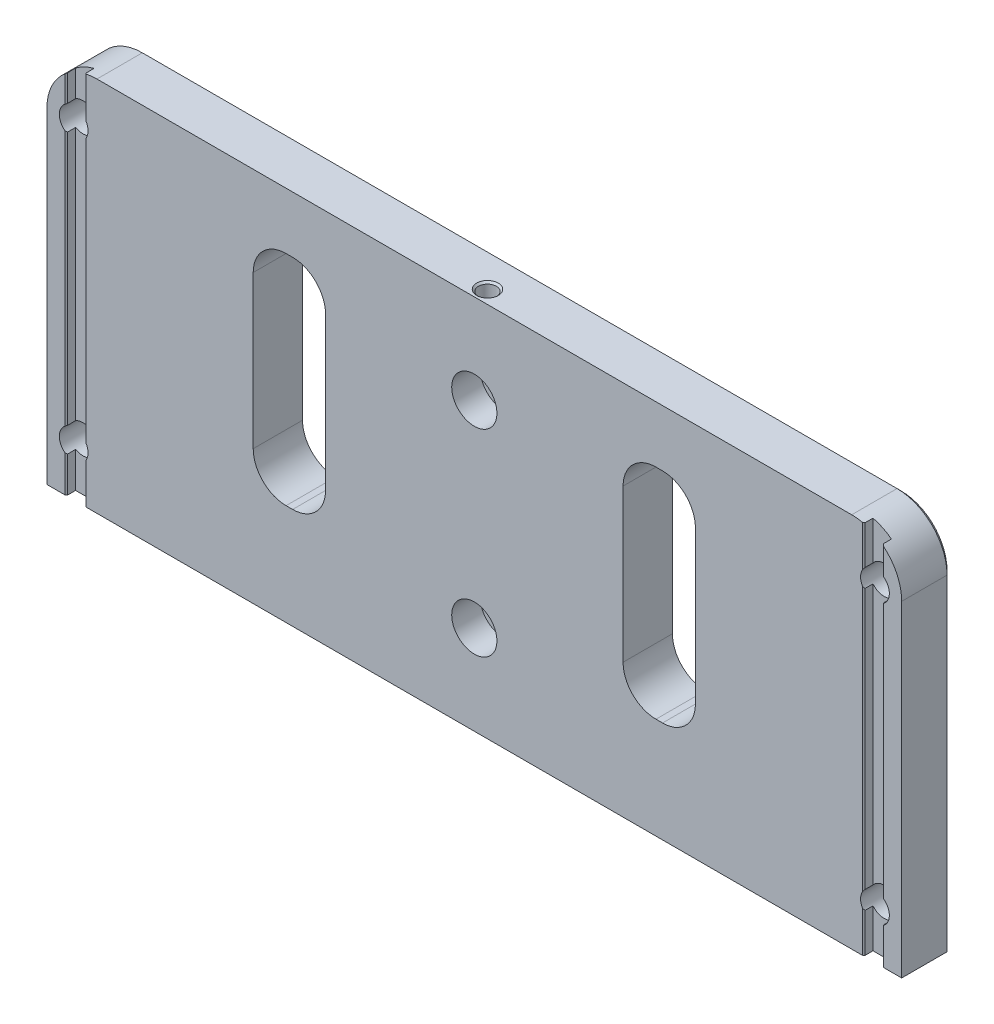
ISO-10303-21;
HEADER;
FILE_DESCRIPTION(('STEP AP214'),'2;1');
FILE_NAME('part.step','',(''),(''),'','','');
FILE_SCHEMA(('AUTOMOTIVE_DESIGN { 1 0 10303 214 1 1 1 1 }'));
ENDSEC;
DATA;
#1=APPLICATION_CONTEXT('core data for automotive mechanical design processes');
#2=APPLICATION_PROTOCOL_DEFINITION('international standard','automotive_design',2000,#1);
#3=PRODUCT_CONTEXT('',#1,'mechanical');
#4=PRODUCT('Part','Part','',(#3));
#5=PRODUCT_RELATED_PRODUCT_CATEGORY('part','',(#4));
#6=PRODUCT_DEFINITION_FORMATION('','',#4);
#7=PRODUCT_DEFINITION_CONTEXT('part definition',#1,'design');
#8=PRODUCT_DEFINITION('design','',#6,#7);
#9=PRODUCT_DEFINITION_SHAPE('','',#8);
#10=(LENGTH_UNIT() NAMED_UNIT(*) SI_UNIT(.MILLI.,.METRE.));
#11=(NAMED_UNIT(*) PLANE_ANGLE_UNIT() SI_UNIT($,.RADIAN.));
#12=(NAMED_UNIT(*) SI_UNIT($,.STERADIAN.) SOLID_ANGLE_UNIT());
#13=UNCERTAINTY_MEASURE_WITH_UNIT(LENGTH_MEASURE(1.E-05),#10,'distance_accuracy_value','');
#14=(GEOMETRIC_REPRESENTATION_CONTEXT(3) GLOBAL_UNCERTAINTY_ASSIGNED_CONTEXT((#13)) GLOBAL_UNIT_ASSIGNED_CONTEXT((#10,
#11,#12)) REPRESENTATION_CONTEXT('',''));
#15=CARTESIAN_POINT('',(0.,0.,0.));
#16=DIRECTION('',(0.,0.,1.));
#17=DIRECTION('',(1.,0.,0.));
#18=AXIS2_PLACEMENT_3D('',#15,#16,#17);
#19=CARTESIAN_POINT('',(78.7654,72.898,-16.256));
#20=DIRECTION('',(0.,-1.,0.));
#21=DIRECTION('',(1.,0.,0.));
#22=AXIS2_PLACEMENT_3D('',#19,#20,#21);
#23=PLANE('',#22);
#24=DIRECTION('',(0.,0.,1.));
#25=VECTOR('',#24,1.);
#26=CARTESIAN_POINT('',(72.8726,72.898,-25.781));
#27=LINE('',#26,#25);
#28=CARTESIAN_POINT('',(72.8726,72.898,-16.256));
#29=VERTEX_POINT('',#28);
#30=CARTESIAN_POINT('',(72.8726,72.898,-25.019));
#31=VERTEX_POINT('',#30);
#32=EDGE_CURVE('E781',#29,#31,#27,.F.);
#33=ORIENTED_EDGE('',*,*,#32,.T.);
#34=DIRECTION('',(-1.,0.,0.));
#35=VECTOR('',#34,1.);
#36=CARTESIAN_POINT('',(-72.8726,72.898,-25.019));
#37=LINE('',#36,#35);
#38=CARTESIAN_POINT('',(-72.8726,72.898,-25.019));
#39=VERTEX_POINT('',#38);
#40=EDGE_CURVE('E847',#31,#39,#37,.T.);
#41=ORIENTED_EDGE('',*,*,#40,.T.);
#42=DIRECTION('',(0.,0.,1.));
#43=VECTOR('',#42,1.);
#44=CARTESIAN_POINT('',(-72.8726,72.898,-16.256));
#45=LINE('',#44,#43);
#46=CARTESIAN_POINT('',(-72.8726,72.898,-16.256));
#47=VERTEX_POINT('',#46);
#48=EDGE_CURVE('E793',#39,#47,#45,.T.);
#49=ORIENTED_EDGE('',*,*,#48,.T.);
#50=DIRECTION('',(-1.,0.,0.));
#51=VECTOR('',#50,1.);
#52=CARTESIAN_POINT('',(73.8378,72.898,-16.256));
#53=LINE('',#52,#51);
#54=EDGE_CURVE('E576',#29,#47,#53,.T.);
#55=ORIENTED_EDGE('',*,*,#54,.F.);
#56=EDGE_LOOP('',(#33,#41,#49,#55));
#57=FACE_BOUND('',#56,.T.);
#58=DIRECTION('',(0.999999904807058,0.,0.000436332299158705));
#59=VECTOR('',#58,1.);
#60=CARTESIAN_POINT('',(2.08279980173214,72.898,-18.7950912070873));
#61=LINE('',#60,#59);
#62=CARTESIAN_POINT('',(2.08305380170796,72.898,-18.7950910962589));
#63=VERTEX_POINT('',#62);
#64=CARTESIAN_POINT('',(2.08279980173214,72.898,-18.7950912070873));
#65=VERTEX_POINT('',#64);
#66=EDGE_CURVE('E957',#63,#65,#61,.F.);
#67=ORIENTED_EDGE('',*,*,#66,.F.);
#68=CARTESIAN_POINT('',(0.,72.898,-18.796));
#69=DIRECTION('',(0.,1.,0.));
#70=DIRECTION('',(0.,0.,1.));
#71=AXIS2_PLACEMENT_3D('',#68,#69,#70);
#72=CIRCLE('',#71,2.083054);
#73=CARTESIAN_POINT('',(2.083054,72.898,-18.796));
#74=VERTEX_POINT('',#73);
#75=EDGE_CURVE('E988',#74,#63,#72,.T.);
#76=ORIENTED_EDGE('',*,*,#75,.F.);
#77=DIRECTION('',(1.,0.,0.));
#78=VECTOR('',#77,1.);
#79=CARTESIAN_POINT('',(2.0828,72.898,-18.796));
#80=LINE('',#79,#78);
#81=CARTESIAN_POINT('',(2.0828,72.898,-18.796));
#82=VERTEX_POINT('',#81);
#83=EDGE_CURVE('E19',#74,#82,#80,.F.);
#84=ORIENTED_EDGE('',*,*,#83,.T.);
#85=CARTESIAN_POINT('',(0.,72.898,-18.796));
#86=DIRECTION('',(0.,-1.,0.));
#87=DIRECTION('',(1.,0.,0.));
#88=AXIS2_PLACEMENT_3D('',#85,#86,#87);
#89=CIRCLE('',#88,2.0828);
#90=EDGE_CURVE('E25',#82,#65,#89,.T.);
#91=ORIENTED_EDGE('',*,*,#90,.T.);
#92=EDGE_LOOP('',(#67,#76,#84,#91));
#93=FACE_BOUND('',#92,.T.);
#94=ADVANCED_FACE('F15',(#57,#93),#23,.F.);
#95=CARTESIAN_POINT('',(73.8378,72.898,-16.256));
#96=DIRECTION('',(0.,0.,1.));
#97=DIRECTION('',(1.,0.,0.));
#98=AXIS2_PLACEMENT_3D('',#95,#96,#97);
#99=PLANE('',#98);
#100=CARTESIAN_POINT('',(0.,17.526,-16.256));
#101=DIRECTION('',(0.,0.,-1.));
#102=DIRECTION('',(-1.,0.,0.));
#103=AXIS2_PLACEMENT_3D('',#100,#101,#102);
#104=CIRCLE('',#103,4.365625);
#105=CARTESIAN_POINT('',(-4.365625,17.526,-16.256));
#106=VERTEX_POINT('',#105);
#107=EDGE_CURVE('E493',#106,#106,#104,.T.);
#108=ORIENTED_EDGE('',*,*,#107,.T.);
#109=EDGE_LOOP('',(#108));
#110=FACE_BOUND('',#109,.T.);
#111=CARTESIAN_POINT('',(0.,55.626,-16.256));
#112=DIRECTION('',(0.,0.,-1.));
#113=DIRECTION('',(-1.,0.,0.));
#114=AXIS2_PLACEMENT_3D('',#111,#112,#113);
#115=CIRCLE('',#114,4.365625);
#116=CARTESIAN_POINT('',(-4.365625,55.626,-16.256));
#117=VERTEX_POINT('',#116);
#118=EDGE_CURVE('E504',#117,#117,#115,.T.);
#119=ORIENTED_EDGE('',*,*,#118,.T.);
#120=EDGE_LOOP('',(#119));
#121=FACE_BOUND('',#120,.T.);
#122=DIRECTION('',(-1.,0.,0.));
#123=VECTOR('',#122,1.);
#124=CARTESIAN_POINT('',(-28.7274,61.976,-16.256));
#125=LINE('',#124,#123);
#126=CARTESIAN_POINT('',(-35.0774,61.976,-16.256));
#127=VERTEX_POINT('',#126);
#128=CARTESIAN_POINT('',(-36.3474,61.976,-16.256));
#129=VERTEX_POINT('',#128);
#130=EDGE_CURVE('E507',#127,#129,#125,.T.);
#131=ORIENTED_EDGE('',*,*,#130,.F.);
#132=CARTESIAN_POINT('',(-35.0774,55.626,-16.256));
#133=DIRECTION('',(0.,0.,1.));
#134=DIRECTION('',(1.,0.,0.));
#135=AXIS2_PLACEMENT_3D('',#132,#133,#134);
#136=CIRCLE('',#135,6.35);
#137=CARTESIAN_POINT('',(-28.7274,55.626,-16.256));
#138=VERTEX_POINT('',#137);
#139=EDGE_CURVE('E773',#127,#138,#136,.F.);
#140=ORIENTED_EDGE('',*,*,#139,.T.);
#141=DIRECTION('',(0.,1.,0.));
#142=VECTOR('',#141,1.);
#143=CARTESIAN_POINT('',(-28.7274,19.812,-16.256));
#144=LINE('',#143,#142);
#145=CARTESIAN_POINT('',(-28.7274,26.162,-16.256));
#146=VERTEX_POINT('',#145);
#147=EDGE_CURVE('E517',#146,#138,#144,.T.);
#148=ORIENTED_EDGE('',*,*,#147,.F.);
#149=CARTESIAN_POINT('',(-35.0774,26.162,-16.256));
#150=DIRECTION('',(0.,0.,1.));
#151=DIRECTION('',(1.,0.,0.));
#152=AXIS2_PLACEMENT_3D('',#149,#150,#151);
#153=CIRCLE('',#152,6.35);
#154=CARTESIAN_POINT('',(-35.0774,19.812,-16.256));
#155=VERTEX_POINT('',#154);
#156=EDGE_CURVE('E769',#146,#155,#153,.F.);
#157=ORIENTED_EDGE('',*,*,#156,.T.);
#158=DIRECTION('',(1.,0.,0.));
#159=VECTOR('',#158,1.);
#160=CARTESIAN_POINT('',(-42.6974,19.812,-16.256));
#161=LINE('',#160,#159);
#162=CARTESIAN_POINT('',(-36.3474,19.812,-16.256));
#163=VERTEX_POINT('',#162);
#164=EDGE_CURVE('E514',#163,#155,#161,.T.);
#165=ORIENTED_EDGE('',*,*,#164,.F.);
#166=CARTESIAN_POINT('',(-36.3474,26.162,-16.256));
#167=DIRECTION('',(0.,0.,1.));
#168=DIRECTION('',(1.,0.,0.));
#169=AXIS2_PLACEMENT_3D('',#166,#167,#168);
#170=CIRCLE('',#169,6.35);
#171=CARTESIAN_POINT('',(-42.6974,26.162,-16.256));
#172=VERTEX_POINT('',#171);
#173=EDGE_CURVE('E765',#163,#172,#170,.F.);
#174=ORIENTED_EDGE('',*,*,#173,.T.);
#175=DIRECTION('',(0.,-1.,0.));
#176=VECTOR('',#175,1.);
#177=CARTESIAN_POINT('',(-42.6974,61.976,-16.256));
#178=LINE('',#177,#176);
#179=CARTESIAN_POINT('',(-42.6974,55.626,-16.256));
#180=VERTEX_POINT('',#179);
#181=EDGE_CURVE('E510',#180,#172,#178,.T.);
#182=ORIENTED_EDGE('',*,*,#181,.F.);
#183=CARTESIAN_POINT('',(-36.3474,55.626,-16.256));
#184=DIRECTION('',(0.,0.,1.));
#185=DIRECTION('',(1.,0.,0.));
#186=AXIS2_PLACEMENT_3D('',#183,#184,#185);
#187=CIRCLE('',#186,6.35);
#188=EDGE_CURVE('E777',#180,#129,#187,.F.);
#189=ORIENTED_EDGE('',*,*,#188,.T.);
#190=EDGE_LOOP('',(#131,#140,#148,#157,#165,#174,#182,#189));
#191=FACE_BOUND('',#190,.T.);
#192=CARTESIAN_POINT('',(-72.8726,63.246,-16.256));
#193=DIRECTION('',(0.,0.,1.));
#194=DIRECTION('',(1.,0.,0.));
#195=AXIS2_PLACEMENT_3D('',#192,#193,#194);
#196=CIRCLE('',#195,9.652);
#197=CARTESIAN_POINT('',(-74.9554,72.6705980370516,-16.256));
#198=VERTEX_POINT('',#197);
#199=EDGE_CURVE('E797',#47,#198,#196,.T.);
#200=ORIENTED_EDGE('',*,*,#199,.T.);
#201=DIRECTION('',(0.,-1.,0.));
#202=VECTOR('',#201,1.);
#203=CARTESIAN_POINT('',(-74.9554,72.898,-16.256));
#204=LINE('',#203,#202);
#205=CARTESIAN_POINT('',(-74.9554,64.7497387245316,-16.256));
#206=VERTEX_POINT('',#205);
#207=EDGE_CURVE('E861',#198,#206,#204,.T.);
#208=ORIENTED_EDGE('',*,*,#207,.T.);
#209=CARTESIAN_POINT('',(-77.3684,63.373,-16.256));
#210=DIRECTION('',(0.,0.,1.));
#211=DIRECTION('',(1.,0.,0.));
#212=AXIS2_PLACEMENT_3D('',#209,#210,#211);
#213=CIRCLE('',#212,2.778125);
#214=CARTESIAN_POINT('',(-74.9554,61.9962612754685,-16.256));
#215=VERTEX_POINT('',#214);
#216=EDGE_CURVE('E584',#215,#206,#213,.T.);
#217=ORIENTED_EDGE('',*,*,#216,.F.);
#218=DIRECTION('',(0.,-1.,0.));
#219=VECTOR('',#218,1.);
#220=CARTESIAN_POINT('',(-74.9554,72.898,-16.256));
#221=LINE('',#220,#219);
#222=CARTESIAN_POINT('',(-74.9554,10.9017387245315,-16.256));
#223=VERTEX_POINT('',#222);
#224=EDGE_CURVE('E858',#215,#223,#221,.T.);
#225=ORIENTED_EDGE('',*,*,#224,.T.);
#226=CARTESIAN_POINT('',(-77.3684,9.525,-16.256));
#227=DIRECTION('',(0.,0.,1.));
#228=DIRECTION('',(1.,0.,0.));
#229=AXIS2_PLACEMENT_3D('',#226,#227,#228);
#230=CIRCLE('',#229,2.778125);
#231=CARTESIAN_POINT('',(-74.9554,8.14826127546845,-16.256));
#232=VERTEX_POINT('',#231);
#233=EDGE_CURVE('E639',#232,#223,#230,.T.);
#234=ORIENTED_EDGE('',*,*,#233,.F.);
#235=DIRECTION('',(0.,-1.,0.));
#236=VECTOR('',#235,1.);
#237=CARTESIAN_POINT('',(-74.9554,72.898,-16.256));
#238=LINE('',#237,#236);
#239=CARTESIAN_POINT('',(-74.9554,0.254000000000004,-16.256));
#240=VERTEX_POINT('',#239);
#241=EDGE_CURVE('E855',#232,#240,#238,.T.);
#242=ORIENTED_EDGE('',*,*,#241,.T.);
#243=DIRECTION('',(-1.,0.,0.));
#244=VECTOR('',#243,1.);
#245=CARTESIAN_POINT('',(73.8378,0.254000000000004,-16.256));
#246=LINE('',#245,#244);
#247=CARTESIAN_POINT('',(74.9554,0.254000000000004,-16.256));
#248=VERTEX_POINT('',#247);
#249=EDGE_CURVE('E545',#248,#240,#246,.T.);
#250=ORIENTED_EDGE('',*,*,#249,.F.);
#251=DIRECTION('',(0.,1.,0.));
#252=VECTOR('',#251,1.);
#253=CARTESIAN_POINT('',(74.9554,7.77665863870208,-16.256));
#254=LINE('',#253,#252);
#255=CARTESIAN_POINT('',(74.9554,8.14826127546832,-16.256));
#256=VERTEX_POINT('',#255);
#257=EDGE_CURVE('E853',#248,#256,#254,.T.);
#258=ORIENTED_EDGE('',*,*,#257,.T.);
#259=CARTESIAN_POINT('',(77.3684,9.525,-16.256));
#260=DIRECTION('',(0.,0.,1.));
#261=DIRECTION('',(1.,0.,0.));
#262=AXIS2_PLACEMENT_3D('',#259,#260,#261);
#263=CIRCLE('',#262,2.778125);
#264=CARTESIAN_POINT('',(74.9554,10.9017387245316,-16.256));
#265=VERTEX_POINT('',#264);
#266=EDGE_CURVE('E636',#265,#256,#263,.T.);
#267=ORIENTED_EDGE('',*,*,#266,.F.);
#268=DIRECTION('',(0.,1.,0.));
#269=VECTOR('',#268,1.);
#270=CARTESIAN_POINT('',(74.9554,61.6246586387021,-16.256));
#271=LINE('',#270,#269);
#272=CARTESIAN_POINT('',(74.9554,61.9962612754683,-16.256));
#273=VERTEX_POINT('',#272);
#274=EDGE_CURVE('E851',#265,#273,#271,.T.);
#275=ORIENTED_EDGE('',*,*,#274,.T.);
#276=CARTESIAN_POINT('',(77.3684,63.373,-16.256));
#277=DIRECTION('',(0.,0.,1.));
#278=DIRECTION('',(1.,0.,0.));
#279=AXIS2_PLACEMENT_3D('',#276,#277,#278);
#280=CIRCLE('',#279,2.778125);
#281=CARTESIAN_POINT('',(74.9554,64.7497387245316,-16.256));
#282=VERTEX_POINT('',#281);
#283=EDGE_CURVE('E608',#282,#273,#280,.T.);
#284=ORIENTED_EDGE('',*,*,#283,.F.);
#285=DIRECTION('',(0.,1.,0.));
#286=VECTOR('',#285,1.);
#287=CARTESIAN_POINT('',(74.9554,72.6108528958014,-16.256));
#288=LINE('',#287,#286);
#289=CARTESIAN_POINT('',(74.9554,72.6705980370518,-16.256));
#290=VERTEX_POINT('',#289);
#291=EDGE_CURVE('E849',#282,#290,#288,.T.);
#292=ORIENTED_EDGE('',*,*,#291,.T.);
#293=CARTESIAN_POINT('',(72.8726,63.246,-16.256));
#294=DIRECTION('',(0.,0.,1.));
#295=DIRECTION('',(1.,0.,0.));
#296=AXIS2_PLACEMENT_3D('',#293,#294,#295);
#297=CIRCLE('',#296,9.652);
#298=EDGE_CURVE('E795',#290,#29,#297,.T.);
#299=ORIENTED_EDGE('',*,*,#298,.T.);
#300=ORIENTED_EDGE('',*,*,#54,.T.);
#301=EDGE_LOOP('',(#200,#208,#217,#225,#234,#242,#250,#258,#267,#275,#284,#292,#299,#300));
#302=FACE_BOUND('',#301,.T.);
#303=DIRECTION('',(-1.,0.,0.));
#304=VECTOR('',#303,1.);
#305=CARTESIAN_POINT('',(42.6974,19.812,-16.256));
#306=LINE('',#305,#304);
#307=CARTESIAN_POINT('',(36.3474,19.812,-16.256));
#308=VERTEX_POINT('',#307);
#309=CARTESIAN_POINT('',(35.0774,19.812,-16.256));
#310=VERTEX_POINT('',#309);
#311=EDGE_CURVE('E526',#308,#310,#306,.T.);
#312=ORIENTED_EDGE('',*,*,#311,.T.);
#313=CARTESIAN_POINT('',(35.0774,26.162,-16.256));
#314=DIRECTION('',(0.,0.,1.));
#315=DIRECTION('',(1.,0.,0.));
#316=AXIS2_PLACEMENT_3D('',#313,#314,#315);
#317=CIRCLE('',#316,6.35);
#318=CARTESIAN_POINT('',(28.7274,26.162,-16.256));
#319=VERTEX_POINT('',#318);
#320=EDGE_CURVE('E749',#310,#319,#317,.F.);
#321=ORIENTED_EDGE('',*,*,#320,.T.);
#322=DIRECTION('',(0.,1.,0.));
#323=VECTOR('',#322,1.);
#324=CARTESIAN_POINT('',(28.7274,19.812,-16.256));
#325=LINE('',#324,#323);
#326=CARTESIAN_POINT('',(28.7274,55.626,-16.256));
#327=VERTEX_POINT('',#326);
#328=EDGE_CURVE('E529',#319,#327,#325,.T.);
#329=ORIENTED_EDGE('',*,*,#328,.T.);
#330=CARTESIAN_POINT('',(35.0774,55.626,-16.256));
#331=DIRECTION('',(0.,0.,1.));
#332=DIRECTION('',(1.,0.,0.));
#333=AXIS2_PLACEMENT_3D('',#330,#331,#332);
#334=CIRCLE('',#333,6.35);
#335=CARTESIAN_POINT('',(35.0774,61.976,-16.256));
#336=VERTEX_POINT('',#335);
#337=EDGE_CURVE('E761',#327,#336,#334,.F.);
#338=ORIENTED_EDGE('',*,*,#337,.T.);
#339=DIRECTION('',(1.,0.,0.));
#340=VECTOR('',#339,1.);
#341=CARTESIAN_POINT('',(28.7274,61.976,-16.256));
#342=LINE('',#341,#340);
#343=CARTESIAN_POINT('',(36.3474,61.976,-16.256));
#344=VERTEX_POINT('',#343);
#345=EDGE_CURVE('E520',#336,#344,#342,.T.);
#346=ORIENTED_EDGE('',*,*,#345,.T.);
#347=CARTESIAN_POINT('',(36.3474,55.626,-16.256));
#348=DIRECTION('',(0.,0.,1.));
#349=DIRECTION('',(1.,0.,0.));
#350=AXIS2_PLACEMENT_3D('',#347,#348,#349);
#351=CIRCLE('',#350,6.35);
#352=CARTESIAN_POINT('',(42.6974,55.626,-16.256));
#353=VERTEX_POINT('',#352);
#354=EDGE_CURVE('E757',#344,#353,#351,.F.);
#355=ORIENTED_EDGE('',*,*,#354,.T.);
#356=DIRECTION('',(0.,-1.,0.));
#357=VECTOR('',#356,1.);
#358=CARTESIAN_POINT('',(42.6974,61.976,-16.256));
#359=LINE('',#358,#357);
#360=CARTESIAN_POINT('',(42.6974,26.162,-16.256));
#361=VERTEX_POINT('',#360);
#362=EDGE_CURVE('E523',#353,#361,#359,.T.);
#363=ORIENTED_EDGE('',*,*,#362,.T.);
#364=CARTESIAN_POINT('',(36.3474,26.162,-16.256));
#365=DIRECTION('',(0.,0.,1.));
#366=DIRECTION('',(1.,0.,0.));
#367=AXIS2_PLACEMENT_3D('',#364,#365,#366);
#368=CIRCLE('',#367,6.35);
#369=EDGE_CURVE('E753',#361,#308,#368,.F.);
#370=ORIENTED_EDGE('',*,*,#369,.T.);
#371=EDGE_LOOP('',(#312,#321,#329,#338,#346,#355,#363,#370));
#372=FACE_BOUND('',#371,.T.);
#373=ADVANCED_FACE('F1024',(#110,#121,#191,#302,#372),#99,.T.);
#374=CARTESIAN_POINT('',(-82.5246,72.898,-25.781));
#375=DIRECTION('',(0.,0.,-1.));
#376=DIRECTION('',(-1.,0.,0.));
#377=AXIS2_PLACEMENT_3D('',#374,#375,#376);
#378=PLANE('',#377);
#379=DIRECTION('',(1.,0.,0.));
#380=VECTOR('',#379,1.);
#381=CARTESIAN_POINT('',(72.8726,72.136,-25.781));
#382=LINE('',#381,#380);
#383=CARTESIAN_POINT('',(-72.8726,72.136,-25.781));
#384=VERTEX_POINT('',#383);
#385=CARTESIAN_POINT('',(72.8726,72.136,-25.781));
#386=VERTEX_POINT('',#385);
#387=EDGE_CURVE('E823',#384,#386,#382,.T.);
#388=ORIENTED_EDGE('',*,*,#387,.T.);
#389=CARTESIAN_POINT('',(72.8726,63.246,-25.781));
#390=DIRECTION('',(0.,0.,-1.));
#391=DIRECTION('',(-1.,0.,0.));
#392=AXIS2_PLACEMENT_3D('',#389,#390,#391);
#393=CIRCLE('',#392,8.89);
#394=CARTESIAN_POINT('',(81.7626,63.246,-25.781));
#395=VERTEX_POINT('',#394);
#396=EDGE_CURVE('E833',#386,#395,#393,.T.);
#397=ORIENTED_EDGE('',*,*,#396,.T.);
#398=DIRECTION('',(0.,-1.,0.));
#399=VECTOR('',#398,1.);
#400=CARTESIAN_POINT('',(81.7626,72.898,-25.781));
#401=LINE('',#400,#399);
#402=CARTESIAN_POINT('',(81.7626,1.016,-25.781));
#403=VERTEX_POINT('',#402);
#404=EDGE_CURVE('E831',#395,#403,#401,.T.);
#405=ORIENTED_EDGE('',*,*,#404,.T.);
#406=DIRECTION('',(-1.,0.,0.));
#407=VECTOR('',#406,1.);
#408=CARTESIAN_POINT('',(-82.5246,1.016,-25.781));
#409=LINE('',#408,#407);
#410=CARTESIAN_POINT('',(-81.7626,1.016,-25.781));
#411=VERTEX_POINT('',#410);
#412=EDGE_CURVE('E829',#403,#411,#409,.T.);
#413=ORIENTED_EDGE('',*,*,#412,.T.);
#414=DIRECTION('',(0.,1.,0.));
#415=VECTOR('',#414,1.);
#416=CARTESIAN_POINT('',(-81.7626,63.246,-25.781));
#417=LINE('',#416,#415);
#418=CARTESIAN_POINT('',(-81.7626,63.246,-25.781));
#419=VERTEX_POINT('',#418);
#420=EDGE_CURVE('E827',#411,#419,#417,.T.);
#421=ORIENTED_EDGE('',*,*,#420,.T.);
#422=CARTESIAN_POINT('',(-72.8726,63.246,-25.781));
#423=DIRECTION('',(0.,0.,-1.));
#424=DIRECTION('',(-1.,0.,0.));
#425=AXIS2_PLACEMENT_3D('',#422,#423,#424);
#426=CIRCLE('',#425,8.89);
#427=EDGE_CURVE('E825',#419,#384,#426,.T.);
#428=ORIENTED_EDGE('',*,*,#427,.T.);
#429=EDGE_LOOP('',(#388,#397,#405,#413,#421,#428));
#430=FACE_BOUND('',#429,.T.);
#431=CARTESIAN_POINT('',(0.,17.526,-25.781));
#432=DIRECTION('',(0.,0.,-1.));
#433=DIRECTION('',(-1.,0.,0.));
#434=AXIS2_PLACEMENT_3D('',#431,#432,#433);
#435=CIRCLE('',#434,2.778125);
#436=CARTESIAN_POINT('',(-2.778125,17.526,-25.781));
#437=VERTEX_POINT('',#436);
#438=EDGE_CURVE('E784',#437,#437,#435,.T.);
#439=ORIENTED_EDGE('',*,*,#438,.F.);
#440=EDGE_LOOP('',(#439));
#441=FACE_BOUND('',#440,.T.);
#442=CARTESIAN_POINT('',(0.,55.626,-25.781));
#443=DIRECTION('',(0.,0.,-1.));
#444=DIRECTION('',(-1.,0.,0.));
#445=AXIS2_PLACEMENT_3D('',#442,#443,#444);
#446=CIRCLE('',#445,2.778125);
#447=CARTESIAN_POINT('',(-2.778125,55.626,-25.781));
#448=VERTEX_POINT('',#447);
#449=EDGE_CURVE('E511',#448,#448,#446,.T.);
#450=ORIENTED_EDGE('',*,*,#449,.F.);
#451=EDGE_LOOP('',(#450));
#452=FACE_BOUND('',#451,.T.);
#453=DIRECTION('',(1.,0.,0.));
#454=VECTOR('',#453,1.);
#455=CARTESIAN_POINT('',(-82.5246,61.976,-25.781));
#456=LINE('',#455,#454);
#457=CARTESIAN_POINT('',(-36.3474,61.976,-25.781));
#458=VERTEX_POINT('',#457);
#459=CARTESIAN_POINT('',(-35.0774,61.976,-25.781));
#460=VERTEX_POINT('',#459);
#461=EDGE_CURVE('E706',#458,#460,#456,.T.);
#462=ORIENTED_EDGE('',*,*,#461,.F.);
#463=CARTESIAN_POINT('',(-36.3474,55.626,-25.781));
#464=DIRECTION('',(0.,0.,-1.));
#465=DIRECTION('',(-1.,0.,0.));
#466=AXIS2_PLACEMENT_3D('',#463,#464,#465);
#467=CIRCLE('',#466,6.35);
#468=CARTESIAN_POINT('',(-42.6974,55.626,-25.781));
#469=VERTEX_POINT('',#468);
#470=EDGE_CURVE('E779',#458,#469,#467,.F.);
#471=ORIENTED_EDGE('',*,*,#470,.T.);
#472=DIRECTION('',(0.,1.,0.));
#473=VECTOR('',#472,1.);
#474=CARTESIAN_POINT('',(-42.6974,72.898,-25.781));
#475=LINE('',#474,#473);
#476=CARTESIAN_POINT('',(-42.6974,26.162,-25.781));
#477=VERTEX_POINT('',#476);
#478=EDGE_CURVE('E703',#477,#469,#475,.T.);
#479=ORIENTED_EDGE('',*,*,#478,.F.);
#480=CARTESIAN_POINT('',(-36.3474,26.162,-25.781));
#481=DIRECTION('',(0.,0.,-1.));
#482=DIRECTION('',(-1.,0.,0.));
#483=AXIS2_PLACEMENT_3D('',#480,#481,#482);
#484=CIRCLE('',#483,6.35);
#485=CARTESIAN_POINT('',(-36.3474,19.812,-25.781));
#486=VERTEX_POINT('',#485);
#487=EDGE_CURVE('E767',#477,#486,#484,.F.);
#488=ORIENTED_EDGE('',*,*,#487,.T.);
#489=DIRECTION('',(-1.,0.,0.));
#490=VECTOR('',#489,1.);
#491=CARTESIAN_POINT('',(-82.5246,19.812,-25.781));
#492=LINE('',#491,#490);
#493=CARTESIAN_POINT('',(-35.0774,19.812,-25.781));
#494=VERTEX_POINT('',#493);
#495=EDGE_CURVE('E700',#494,#486,#492,.T.);
#496=ORIENTED_EDGE('',*,*,#495,.F.);
#497=CARTESIAN_POINT('',(-35.0774,26.162,-25.781));
#498=DIRECTION('',(0.,0.,-1.));
#499=DIRECTION('',(-1.,0.,0.));
#500=AXIS2_PLACEMENT_3D('',#497,#498,#499);
#501=CIRCLE('',#500,6.35);
#502=CARTESIAN_POINT('',(-28.7274,26.162,-25.781));
#503=VERTEX_POINT('',#502);
#504=EDGE_CURVE('E771',#494,#503,#501,.F.);
#505=ORIENTED_EDGE('',*,*,#504,.T.);
#506=DIRECTION('',(0.,-1.,0.));
#507=VECTOR('',#506,1.);
#508=CARTESIAN_POINT('',(-28.7274,72.898,-25.781));
#509=LINE('',#508,#507);
#510=CARTESIAN_POINT('',(-28.7274,55.626,-25.781));
#511=VERTEX_POINT('',#510);
#512=EDGE_CURVE('E697',#511,#503,#509,.T.);
#513=ORIENTED_EDGE('',*,*,#512,.F.);
#514=CARTESIAN_POINT('',(-35.0774,55.626,-25.781));
#515=DIRECTION('',(0.,0.,-1.));
#516=DIRECTION('',(-1.,0.,0.));
#517=AXIS2_PLACEMENT_3D('',#514,#515,#516);
#518=CIRCLE('',#517,6.35);
#519=EDGE_CURVE('E775',#511,#460,#518,.F.);
#520=ORIENTED_EDGE('',*,*,#519,.T.);
#521=EDGE_LOOP('',(#462,#471,#479,#488,#496,#505,#513,#520));
#522=FACE_BOUND('',#521,.T.);
#523=DIRECTION('',(1.,0.,0.));
#524=VECTOR('',#523,1.);
#525=CARTESIAN_POINT('',(-82.5246,61.976,-25.781));
#526=LINE('',#525,#524);
#527=CARTESIAN_POINT('',(35.0774,61.976,-25.781));
#528=VERTEX_POINT('',#527);
#529=CARTESIAN_POINT('',(36.3474,61.976,-25.781));
#530=VERTEX_POINT('',#529);
#531=EDGE_CURVE('E694',#528,#530,#526,.T.);
#532=ORIENTED_EDGE('',*,*,#531,.F.);
#533=CARTESIAN_POINT('',(35.0774,55.626,-25.781));
#534=DIRECTION('',(0.,0.,-1.));
#535=DIRECTION('',(-1.,0.,0.));
#536=AXIS2_PLACEMENT_3D('',#533,#534,#535);
#537=CIRCLE('',#536,6.35);
#538=CARTESIAN_POINT('',(28.7274,55.626,-25.781));
#539=VERTEX_POINT('',#538);
#540=EDGE_CURVE('E763',#528,#539,#537,.F.);
#541=ORIENTED_EDGE('',*,*,#540,.T.);
#542=DIRECTION('',(0.,1.,0.));
#543=VECTOR('',#542,1.);
#544=CARTESIAN_POINT('',(28.7274,72.898,-25.781));
#545=LINE('',#544,#543);
#546=CARTESIAN_POINT('',(28.7274,26.162,-25.781));
#547=VERTEX_POINT('',#546);
#548=EDGE_CURVE('E590',#547,#539,#545,.T.);
#549=ORIENTED_EDGE('',*,*,#548,.F.);
#550=CARTESIAN_POINT('',(35.0774,26.162,-25.781));
#551=DIRECTION('',(0.,0.,-1.));
#552=DIRECTION('',(-1.,0.,0.));
#553=AXIS2_PLACEMENT_3D('',#550,#551,#552);
#554=CIRCLE('',#553,6.35);
#555=CARTESIAN_POINT('',(35.0774,19.812,-25.781));
#556=VERTEX_POINT('',#555);
#557=EDGE_CURVE('E751',#547,#556,#554,.F.);
#558=ORIENTED_EDGE('',*,*,#557,.T.);
#559=DIRECTION('',(-1.,0.,0.));
#560=VECTOR('',#559,1.);
#561=CARTESIAN_POINT('',(-82.5246,19.812,-25.781));
#562=LINE('',#561,#560);
#563=CARTESIAN_POINT('',(36.3474,19.812,-25.781));
#564=VERTEX_POINT('',#563);
#565=EDGE_CURVE('E688',#564,#556,#562,.T.);
#566=ORIENTED_EDGE('',*,*,#565,.F.);
#567=CARTESIAN_POINT('',(36.3474,26.162,-25.781));
#568=DIRECTION('',(0.,0.,-1.));
#569=DIRECTION('',(-1.,0.,0.));
#570=AXIS2_PLACEMENT_3D('',#567,#568,#569);
#571=CIRCLE('',#570,6.35);
#572=CARTESIAN_POINT('',(42.6974,26.162,-25.781));
#573=VERTEX_POINT('',#572);
#574=EDGE_CURVE('E755',#564,#573,#571,.F.);
#575=ORIENTED_EDGE('',*,*,#574,.T.);
#576=DIRECTION('',(0.,-1.,0.));
#577=VECTOR('',#576,1.);
#578=CARTESIAN_POINT('',(42.6974,72.898,-25.781));
#579=LINE('',#578,#577);
#580=CARTESIAN_POINT('',(42.6974,55.626,-25.781));
#581=VERTEX_POINT('',#580);
#582=EDGE_CURVE('E691',#581,#573,#579,.T.);
#583=ORIENTED_EDGE('',*,*,#582,.F.);
#584=CARTESIAN_POINT('',(36.3474,55.626,-25.781));
#585=DIRECTION('',(0.,0.,-1.));
#586=DIRECTION('',(-1.,0.,0.));
#587=AXIS2_PLACEMENT_3D('',#584,#585,#586);
#588=CIRCLE('',#587,6.35);
#589=EDGE_CURVE('E759',#581,#530,#588,.F.);
#590=ORIENTED_EDGE('',*,*,#589,.T.);
#591=EDGE_LOOP('',(#532,#541,#549,#558,#566,#575,#583,#590));
#592=FACE_BOUND('',#591,.T.);
#593=CARTESIAN_POINT('',(-77.3684,63.373,-25.781));
#594=DIRECTION('',(0.,0.,-1.));
#595=DIRECTION('',(-1.,0.,0.));
#596=AXIS2_PLACEMENT_3D('',#593,#594,#595);
#597=CIRCLE('',#596,2.778125);
#598=CARTESIAN_POINT('',(-80.146525,63.373,-25.781));
#599=VERTEX_POINT('',#598);
#600=EDGE_CURVE('E557',#599,#599,#597,.T.);
#601=ORIENTED_EDGE('',*,*,#600,.F.);
#602=EDGE_LOOP('',(#601));
#603=FACE_BOUND('',#602,.T.);
#604=CARTESIAN_POINT('',(77.3684,63.373,-25.781));
#605=DIRECTION('',(0.,0.,-1.));
#606=DIRECTION('',(-1.,0.,0.));
#607=AXIS2_PLACEMENT_3D('',#604,#605,#606);
#608=CIRCLE('',#607,2.778125);
#609=CARTESIAN_POINT('',(74.590275,63.373,-25.781));
#610=VERTEX_POINT('',#609);
#611=EDGE_CURVE('E594',#610,#610,#608,.T.);
#612=ORIENTED_EDGE('',*,*,#611,.F.);
#613=EDGE_LOOP('',(#612));
#614=FACE_BOUND('',#613,.T.);
#615=CARTESIAN_POINT('',(77.3684,9.525,-25.781));
#616=DIRECTION('',(0.,0.,-1.));
#617=DIRECTION('',(-1.,0.,0.));
#618=AXIS2_PLACEMENT_3D('',#615,#616,#617);
#619=CIRCLE('',#618,2.778125);
#620=CARTESIAN_POINT('',(74.590275,9.525,-25.781));
#621=VERTEX_POINT('',#620);
#622=EDGE_CURVE('E615',#621,#621,#619,.T.);
#623=ORIENTED_EDGE('',*,*,#622,.F.);
#624=EDGE_LOOP('',(#623));
#625=FACE_BOUND('',#624,.T.);
#626=CARTESIAN_POINT('',(-77.3684,9.525,-25.781));
#627=DIRECTION('',(0.,0.,-1.));
#628=DIRECTION('',(-1.,0.,0.));
#629=AXIS2_PLACEMENT_3D('',#626,#627,#628);
#630=CIRCLE('',#629,2.778125);
#631=CARTESIAN_POINT('',(-80.146525,9.525,-25.781));
#632=VERTEX_POINT('',#631);
#633=EDGE_CURVE('E627',#632,#632,#630,.T.);
#634=ORIENTED_EDGE('',*,*,#633,.F.);
#635=EDGE_LOOP('',(#634));
#636=FACE_BOUND('',#635,.T.);
#637=ADVANCED_FACE('F1030',(#430,#441,#452,#522,#592,#603,#614,#625,#636),#378,.T.);
#638=CARTESIAN_POINT('',(78.7654,72.898,-16.256));
#639=DIRECTION('',(0.,0.,-1.));
#640=DIRECTION('',(-1.,0.,0.));
#641=AXIS2_PLACEMENT_3D('',#638,#639,#640);
#642=PLANE('',#641);
#643=CARTESIAN_POINT('',(77.3684,9.525,-16.256));
#644=DIRECTION('',(0.,0.,-1.));
#645=DIRECTION('',(-1.,0.,0.));
#646=AXIS2_PLACEMENT_3D('',#643,#644,#645);
#647=CIRCLE('',#646,2.778125);
#648=CARTESIAN_POINT('',(79.0194,11.7593181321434,-16.256));
#649=VERTEX_POINT('',#648);
#650=CARTESIAN_POINT('',(79.0194,7.29068186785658,-16.256));
#651=VERTEX_POINT('',#650);
#652=EDGE_CURVE('E623',#649,#651,#647,.T.);
#653=ORIENTED_EDGE('',*,*,#652,.T.);
#654=DIRECTION('',(0.,-1.,0.));
#655=VECTOR('',#654,1.);
#656=CARTESIAN_POINT('',(79.0194,72.898,-16.256));
#657=LINE('',#656,#655);
#658=CARTESIAN_POINT('',(79.0194,0.254000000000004,-16.256));
#659=VERTEX_POINT('',#658);
#660=EDGE_CURVE('E919',#651,#659,#657,.T.);
#661=ORIENTED_EDGE('',*,*,#660,.T.);
#662=DIRECTION('',(1.,0.,0.));
#663=VECTOR('',#662,1.);
#664=CARTESIAN_POINT('',(78.7654,0.254000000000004,-16.256));
#665=LINE('',#664,#663);
#666=CARTESIAN_POINT('',(82.5246,0.254000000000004,-16.256));
#667=VERTEX_POINT('',#666);
#668=EDGE_CURVE('E548',#659,#667,#665,.T.);
#669=ORIENTED_EDGE('',*,*,#668,.T.);
#670=DIRECTION('',(0.,-1.,0.));
#671=VECTOR('',#670,1.);
#672=CARTESIAN_POINT('',(82.5246,72.898,-16.256));
#673=LINE('',#672,#671);
#674=CARTESIAN_POINT('',(82.5246,63.246,-16.256));
#675=VERTEX_POINT('',#674);
#676=EDGE_CURVE('E535',#675,#667,#673,.T.);
#677=ORIENTED_EDGE('',*,*,#676,.F.);
#678=CARTESIAN_POINT('',(72.8726,63.246,-16.256));
#679=DIRECTION('',(0.,0.,-1.));
#680=DIRECTION('',(-1.,0.,0.));
#681=AXIS2_PLACEMENT_3D('',#678,#679,#680);
#682=CIRCLE('',#681,9.652);
#683=CARTESIAN_POINT('',(79.0194,70.6876364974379,-16.256));
#684=VERTEX_POINT('',#683);
#685=EDGE_CURVE('E814',#675,#684,#682,.F.);
#686=ORIENTED_EDGE('',*,*,#685,.T.);
#687=DIRECTION('',(0.,-1.,0.));
#688=VECTOR('',#687,1.);
#689=CARTESIAN_POINT('',(79.0194,72.898,-16.256));
#690=LINE('',#689,#688);
#691=CARTESIAN_POINT('',(79.0194,65.6073181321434,-16.256));
#692=VERTEX_POINT('',#691);
#693=EDGE_CURVE('E913',#684,#692,#690,.T.);
#694=ORIENTED_EDGE('',*,*,#693,.T.);
#695=CARTESIAN_POINT('',(77.3684,63.373,-16.256));
#696=DIRECTION('',(0.,0.,-1.));
#697=DIRECTION('',(-1.,0.,0.));
#698=AXIS2_PLACEMENT_3D('',#695,#696,#697);
#699=CIRCLE('',#698,2.778125);
#700=CARTESIAN_POINT('',(79.0194,61.1386818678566,-16.256));
#701=VERTEX_POINT('',#700);
#702=EDGE_CURVE('E619',#692,#701,#699,.T.);
#703=ORIENTED_EDGE('',*,*,#702,.T.);
#704=DIRECTION('',(0.,-1.,0.));
#705=VECTOR('',#704,1.);
#706=CARTESIAN_POINT('',(79.0194,72.898,-16.256));
#707=LINE('',#706,#705);
#708=EDGE_CURVE('E916',#701,#649,#707,.T.);
#709=ORIENTED_EDGE('',*,*,#708,.T.);
#710=EDGE_LOOP('',(#653,#661,#669,#677,#686,#694,#703,#709));
#711=FACE_BOUND('',#710,.T.);
#712=ADVANCED_FACE('F1058',(#711),#642,.F.);
#713=CARTESIAN_POINT('',(0.,0.254,0.));
#714=DIRECTION('',(0.,1.,0.));
#715=DIRECTION('',(0.,0.,1.));
#716=AXIS2_PLACEMENT_3D('',#713,#714,#715);
#717=PLANE('',#716);
#718=ORIENTED_EDGE('',*,*,#249,.T.);
#719=DIRECTION('',(0.707106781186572,0.,0.707106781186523));
#720=VECTOR('',#719,1.);
#721=CARTESIAN_POINT('',(-74.9554,0.254000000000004,-16.256));
#722=LINE('',#721,#720);
#723=CARTESIAN_POINT('',(-75.2094,0.254000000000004,-16.51));
#724=VERTEX_POINT('',#723);
#725=EDGE_CURVE('E906',#240,#724,#722,.F.);
#726=ORIENTED_EDGE('',*,*,#725,.T.);
#727=DIRECTION('',(0.,0.,-1.));
#728=VECTOR('',#727,1.);
#729=CARTESIAN_POINT('',(-75.2094,0.254000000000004,-16.256));
#730=LINE('',#729,#728);
#731=CARTESIAN_POINT('',(-75.2094,0.254000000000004,-18.034));
#732=VERTEX_POINT('',#731);
#733=EDGE_CURVE('E543',#724,#732,#730,.T.);
#734=ORIENTED_EDGE('',*,*,#733,.T.);
#735=DIRECTION('',(-1.,0.,0.));
#736=VECTOR('',#735,1.);
#737=CARTESIAN_POINT('',(-75.2094,0.254000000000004,-18.034));
#738=LINE('',#737,#736);
#739=CARTESIAN_POINT('',(-78.7654,0.254000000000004,-18.034));
#740=VERTEX_POINT('',#739);
#741=EDGE_CURVE('E580',#732,#740,#738,.T.);
#742=ORIENTED_EDGE('',*,*,#741,.T.);
#743=DIRECTION('',(0.,0.,1.));
#744=VECTOR('',#743,1.);
#745=CARTESIAN_POINT('',(-78.7654,0.254000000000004,-17.78));
#746=LINE('',#745,#744);
#747=CARTESIAN_POINT('',(-78.7654,0.254000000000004,-16.51));
#748=VERTEX_POINT('',#747);
#749=EDGE_CURVE('E538',#740,#748,#746,.T.);
#750=ORIENTED_EDGE('',*,*,#749,.T.);
#751=DIRECTION('',(0.707106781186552,0.,-0.707106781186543));
#752=VECTOR('',#751,1.);
#753=CARTESIAN_POINT('',(-78.7654,0.254000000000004,-16.51));
#754=LINE('',#753,#752);
#755=CARTESIAN_POINT('',(-79.0194,0.254000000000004,-16.256));
#756=VERTEX_POINT('',#755);
#757=EDGE_CURVE('E904',#748,#756,#754,.F.);
#758=ORIENTED_EDGE('',*,*,#757,.T.);
#759=DIRECTION('',(-1.,0.,0.));
#760=VECTOR('',#759,1.);
#761=CARTESIAN_POINT('',(-78.7654,0.254000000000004,-16.256));
#762=LINE('',#761,#760);
#763=CARTESIAN_POINT('',(-82.5246,0.254000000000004,-16.256));
#764=VERTEX_POINT('',#763);
#765=EDGE_CURVE('E541',#756,#764,#762,.T.);
#766=ORIENTED_EDGE('',*,*,#765,.T.);
#767=DIRECTION('',(0.,0.,-1.));
#768=VECTOR('',#767,1.);
#769=CARTESIAN_POINT('',(-82.5246,0.254,0.));
#770=LINE('',#769,#768);
#771=CARTESIAN_POINT('',(-82.5246,0.254,-25.019));
#772=VERTEX_POINT('',#771);
#773=EDGE_CURVE('E532',#764,#772,#770,.T.);
#774=ORIENTED_EDGE('',*,*,#773,.T.);
#775=DIRECTION('',(1.,0.,0.));
#776=VECTOR('',#775,1.);
#777=CARTESIAN_POINT('',(82.5246,0.254,-25.019));
#778=LINE('',#777,#776);
#779=CARTESIAN_POINT('',(82.5246,0.254,-25.019));
#780=VERTEX_POINT('',#779);
#781=EDGE_CURVE('E841',#772,#780,#778,.T.);
#782=ORIENTED_EDGE('',*,*,#781,.T.);
#783=DIRECTION('',(0.,0.,-1.));
#784=VECTOR('',#783,1.);
#785=CARTESIAN_POINT('',(82.5246,0.254,0.));
#786=LINE('',#785,#784);
#787=EDGE_CURVE('E583',#667,#780,#786,.T.);
#788=ORIENTED_EDGE('',*,*,#787,.F.);
#789=ORIENTED_EDGE('',*,*,#668,.F.);
#790=DIRECTION('',(0.707106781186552,0.,0.707106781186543));
#791=VECTOR('',#790,1.);
#792=CARTESIAN_POINT('',(79.0194,0.254000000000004,-16.256));
#793=LINE('',#792,#791);
#794=CARTESIAN_POINT('',(78.7654,0.254000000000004,-16.51));
#795=VERTEX_POINT('',#794);
#796=EDGE_CURVE('E902',#659,#795,#793,.F.);
#797=ORIENTED_EDGE('',*,*,#796,.T.);
#798=DIRECTION('',(0.,0.,1.));
#799=VECTOR('',#798,1.);
#800=CARTESIAN_POINT('',(78.7654,0.254000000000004,-17.78));
#801=LINE('',#800,#799);
#802=CARTESIAN_POINT('',(78.7654,0.254000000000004,-18.034));
#803=VERTEX_POINT('',#802);
#804=EDGE_CURVE('E550',#803,#795,#801,.T.);
#805=ORIENTED_EDGE('',*,*,#804,.F.);
#806=DIRECTION('',(1.,0.,0.));
#807=VECTOR('',#806,1.);
#808=CARTESIAN_POINT('',(75.2094,0.254000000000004,-18.034));
#809=LINE('',#808,#807);
#810=CARTESIAN_POINT('',(75.2094,0.254000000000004,-18.034));
#811=VERTEX_POINT('',#810);
#812=EDGE_CURVE('E553',#811,#803,#809,.T.);
#813=ORIENTED_EDGE('',*,*,#812,.F.);
#814=DIRECTION('',(0.,0.,-1.));
#815=VECTOR('',#814,1.);
#816=CARTESIAN_POINT('',(75.2094,0.254000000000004,-16.256));
#817=LINE('',#816,#815);
#818=CARTESIAN_POINT('',(75.2094,0.254000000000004,-16.51));
#819=VERTEX_POINT('',#818);
#820=EDGE_CURVE('E555',#819,#811,#817,.T.);
#821=ORIENTED_EDGE('',*,*,#820,.F.);
#822=DIRECTION('',(-0.707106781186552,0.,0.707106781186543));
#823=VECTOR('',#822,1.);
#824=CARTESIAN_POINT('',(75.2094,0.254000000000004,-16.51));
#825=LINE('',#824,#823);
#826=EDGE_CURVE('E900',#819,#248,#825,.T.);
#827=ORIENTED_EDGE('',*,*,#826,.T.);
#828=EDGE_LOOP('',(#718,#726,#734,#742,#750,#758,#766,#774,#782,#788,#789,#797,#805,#813,#821,#827));
#829=FACE_BOUND('',#828,.T.);
#830=ADVANCED_FACE('F1034',(#829),#717,.F.);
#831=CARTESIAN_POINT('',(-78.7654,72.898,-17.78));
#832=DIRECTION('',(1.,0.,0.));
#833=DIRECTION('',(0.,0.,-1.));
#834=AXIS2_PLACEMENT_3D('',#831,#832,#833);
#835=PLANE('',#834);
#836=DIRECTION('',(0.,0.,1.));
#837=VECTOR('',#836,1.);
#838=CARTESIAN_POINT('',(-78.7654,70.8903451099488,-18.034));
#839=LINE('',#838,#837);
#840=CARTESIAN_POINT('',(-78.7654,70.8903451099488,-18.034));
#841=VERTEX_POINT('',#840);
#842=CARTESIAN_POINT('',(-78.7654,70.8903451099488,-16.51));
#843=VERTEX_POINT('',#842);
#844=EDGE_CURVE('E804',#841,#843,#839,.T.);
#845=ORIENTED_EDGE('',*,*,#844,.T.);
#846=DIRECTION('',(0.,-1.,0.));
#847=VECTOR('',#846,1.);
#848=CARTESIAN_POINT('',(-78.7654,72.898,-16.51));
#849=LINE('',#848,#847);
#850=CARTESIAN_POINT('',(-78.7654,65.7743266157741,-16.51));
#851=VERTEX_POINT('',#850);
#852=EDGE_CURVE('E878',#843,#851,#849,.T.);
#853=ORIENTED_EDGE('',*,*,#852,.T.);
#854=DIRECTION('',(0.,0.,1.));
#855=VECTOR('',#854,1.);
#856=CARTESIAN_POINT('',(-78.7654,65.7743266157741,-17.145));
#857=LINE('',#856,#855);
#858=CARTESIAN_POINT('',(-78.7654,65.7743266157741,-18.034));
#859=VERTEX_POINT('',#858);
#860=EDGE_CURVE('E595',#859,#851,#857,.T.);
#861=ORIENTED_EDGE('',*,*,#860,.F.);
#862=DIRECTION('',(0.,-1.,0.));
#863=VECTOR('',#862,1.);
#864=CARTESIAN_POINT('',(-78.7654,72.898,-18.034));
#865=LINE('',#864,#863);
#866=EDGE_CURVE('E569',#841,#859,#865,.T.);
#867=ORIENTED_EDGE('',*,*,#866,.F.);
#868=EDGE_LOOP('',(#845,#853,#861,#867));
#869=FACE_BOUND('',#868,.T.);
#870=ADVANCED_FACE('F1050',(#869),#835,.T.);
#871=CARTESIAN_POINT('',(-75.2094,72.898,-18.034));
#872=DIRECTION('',(0.,0.,1.));
#873=DIRECTION('',(1.,0.,0.));
#874=AXIS2_PLACEMENT_3D('',#871,#872,#873);
#875=PLANE('',#874);
#876=DIRECTION('',(0.,-1.,0.));
#877=VECTOR('',#876,1.);
#878=CARTESIAN_POINT('',(-75.2094,72.898,-18.034));
#879=LINE('',#878,#877);
#880=CARTESIAN_POINT('',(-75.2094,72.6108528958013,-18.034));
#881=VERTEX_POINT('',#880);
#882=CARTESIAN_POINT('',(-75.2094,65.1213413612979,-18.034));
#883=VERTEX_POINT('',#882);
#884=EDGE_CURVE('E574',#881,#883,#879,.T.);
#885=ORIENTED_EDGE('',*,*,#884,.F.);
#886=CARTESIAN_POINT('',(-72.8726,63.246,-18.034));
#887=DIRECTION('',(0.,0.,1.));
#888=DIRECTION('',(1.,0.,0.));
#889=AXIS2_PLACEMENT_3D('',#886,#887,#888);
#890=CIRCLE('',#889,9.652);
#891=EDGE_CURVE('E802',#881,#841,#890,.T.);
#892=ORIENTED_EDGE('',*,*,#891,.T.);
#893=ORIENTED_EDGE('',*,*,#866,.T.);
#894=CARTESIAN_POINT('',(-77.3684,63.373,-18.034));
#895=DIRECTION('',(0.,0.,1.));
#896=DIRECTION('',(1.,0.,0.));
#897=AXIS2_PLACEMENT_3D('',#894,#895,#896);
#898=CIRCLE('',#897,2.778125);
#899=EDGE_CURVE('E599',#883,#859,#898,.T.);
#900=ORIENTED_EDGE('',*,*,#899,.F.);
#901=EDGE_LOOP('',(#885,#892,#893,#900));
#902=FACE_BOUND('',#901,.T.);
#903=ADVANCED_FACE('F1083',(#902),#875,.T.);
#904=CARTESIAN_POINT('',(-75.2094,72.898,-16.256));
#905=DIRECTION('',(-1.,0.,0.));
#906=DIRECTION('',(0.,0.,1.));
#907=AXIS2_PLACEMENT_3D('',#904,#905,#906);
#908=PLANE('',#907);
#909=DIRECTION('',(0.,0.,1.));
#910=VECTOR('',#909,1.);
#911=CARTESIAN_POINT('',(-75.2094,11.2733413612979,-17.145));
#912=LINE('',#911,#910);
#913=CARTESIAN_POINT('',(-75.2094,11.2733413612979,-16.51));
#914=VERTEX_POINT('',#913);
#915=CARTESIAN_POINT('',(-75.2094,11.2733413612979,-18.034));
#916=VERTEX_POINT('',#915);
#917=EDGE_CURVE('E675',#914,#916,#912,.F.);
#918=ORIENTED_EDGE('',*,*,#917,.F.);
#919=DIRECTION('',(0.,1.,0.));
#920=VECTOR('',#919,1.);
#921=CARTESIAN_POINT('',(-75.2094,72.898,-16.51));
#922=LINE('',#921,#920);
#923=CARTESIAN_POINT('',(-75.2094,61.6246586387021,-16.51));
#924=VERTEX_POINT('',#923);
#925=EDGE_CURVE('E895',#914,#924,#922,.T.);
#926=ORIENTED_EDGE('',*,*,#925,.T.);
#927=DIRECTION('',(0.,0.,1.));
#928=VECTOR('',#927,1.);
#929=CARTESIAN_POINT('',(-75.2094,61.6246586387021,-17.145));
#930=LINE('',#929,#928);
#931=CARTESIAN_POINT('',(-75.2094,61.6246586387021,-18.034));
#932=VERTEX_POINT('',#931);
#933=EDGE_CURVE('E605',#932,#924,#930,.T.);
#934=ORIENTED_EDGE('',*,*,#933,.F.);
#935=EDGE_CURVE('E571',#932,#916,#879,.T.);
#936=ORIENTED_EDGE('',*,*,#935,.T.);
#937=EDGE_LOOP('',(#918,#926,#934,#936));
#938=FACE_BOUND('',#937,.T.);
#939=ADVANCED_FACE('F1043',(#938),#908,.T.);
#940=CARTESIAN_POINT('',(75.2094,72.898,-18.034));
#941=DIRECTION('',(0.,0.,-1.));
#942=DIRECTION('',(-1.,0.,0.));
#943=AXIS2_PLACEMENT_3D('',#940,#941,#942);
#944=PLANE('',#943);
#945=DIRECTION('',(0.,-1.,0.));
#946=VECTOR('',#945,1.);
#947=CARTESIAN_POINT('',(78.7654,72.898,-18.034));
#948=LINE('',#947,#946);
#949=CARTESIAN_POINT('',(78.7654,70.890345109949,-18.034));
#950=VERTEX_POINT('',#949);
#951=CARTESIAN_POINT('',(78.7654,65.7743266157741,-18.034));
#952=VERTEX_POINT('',#951);
#953=EDGE_CURVE('E565',#950,#952,#948,.T.);
#954=ORIENTED_EDGE('',*,*,#953,.F.);
#955=CARTESIAN_POINT('',(72.8726,63.246,-18.034));
#956=DIRECTION('',(0.,0.,-1.));
#957=DIRECTION('',(-1.,0.,0.));
#958=AXIS2_PLACEMENT_3D('',#955,#956,#957);
#959=CIRCLE('',#958,9.652);
#960=CARTESIAN_POINT('',(75.2094,72.6108528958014,-18.034));
#961=VERTEX_POINT('',#960);
#962=EDGE_CURVE('E819',#950,#961,#959,.F.);
#963=ORIENTED_EDGE('',*,*,#962,.T.);
#964=DIRECTION('',(0.,-1.,0.));
#965=VECTOR('',#964,1.);
#966=CARTESIAN_POINT('',(75.2094,72.898,-18.034));
#967=LINE('',#966,#965);
#968=CARTESIAN_POINT('',(75.2094,65.1213413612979,-18.034));
#969=VERTEX_POINT('',#968);
#970=EDGE_CURVE('E561',#961,#969,#967,.T.);
#971=ORIENTED_EDGE('',*,*,#970,.T.);
#972=CARTESIAN_POINT('',(77.3684,63.373,-18.034));
#973=DIRECTION('',(0.,0.,-1.));
#974=DIRECTION('',(-1.,0.,0.));
#975=AXIS2_PLACEMENT_3D('',#972,#973,#974);
#976=CIRCLE('',#975,2.778125);
#977=EDGE_CURVE('E653',#969,#952,#976,.T.);
#978=ORIENTED_EDGE('',*,*,#977,.T.);
#979=EDGE_LOOP('',(#954,#963,#971,#978));
#980=FACE_BOUND('',#979,.T.);
#981=ADVANCED_FACE('F1078',(#980),#944,.F.);
#982=CARTESIAN_POINT('',(78.7654,72.898,-17.78));
#983=DIRECTION('',(1.,0.,0.));
#984=DIRECTION('',(0.,0.,-1.));
#985=AXIS2_PLACEMENT_3D('',#982,#983,#984);
#986=PLANE('',#985);
#987=DIRECTION('',(0.,0.,1.));
#988=VECTOR('',#987,1.);
#989=CARTESIAN_POINT('',(78.7654,65.7743266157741,-17.145));
#990=LINE('',#989,#988);
#991=CARTESIAN_POINT('',(78.7654,65.7743266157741,-16.51));
#992=VERTEX_POINT('',#991);
#993=EDGE_CURVE('E646',#952,#992,#990,.T.);
#994=ORIENTED_EDGE('',*,*,#993,.T.);
#995=DIRECTION('',(0.,1.,0.));
#996=VECTOR('',#995,1.);
#997=CARTESIAN_POINT('',(78.7654,72.898,-16.51));
#998=LINE('',#997,#996);
#999=CARTESIAN_POINT('',(78.7654,70.890345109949,-16.51));
#1000=VERTEX_POINT('',#999);
#1001=EDGE_CURVE('E948',#992,#1000,#998,.T.);
#1002=ORIENTED_EDGE('',*,*,#1001,.T.);
#1003=DIRECTION('',(0.,0.,-1.));
#1004=VECTOR('',#1003,1.);
#1005=CARTESIAN_POINT('',(78.7654,70.890345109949,-16.256));
#1006=LINE('',#1005,#1004);
#1007=EDGE_CURVE('E817',#1000,#950,#1006,.T.);
#1008=ORIENTED_EDGE('',*,*,#1007,.T.);
#1009=ORIENTED_EDGE('',*,*,#953,.T.);
#1010=EDGE_LOOP('',(#994,#1002,#1008,#1009));
#1011=FACE_BOUND('',#1010,.T.);
#1012=ADVANCED_FACE('F1067',(#1011),#986,.F.);
#1013=CARTESIAN_POINT('',(75.2094,72.898,-16.256));
#1014=DIRECTION('',(-1.,0.,0.));
#1015=DIRECTION('',(0.,0.,1.));
#1016=AXIS2_PLACEMENT_3D('',#1013,#1014,#1015);
#1017=PLANE('',#1016);
#1018=DIRECTION('',(0.,0.,1.));
#1019=VECTOR('',#1018,1.);
#1020=CARTESIAN_POINT('',(75.2094,61.6246586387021,-17.145));
#1021=LINE('',#1020,#1019);
#1022=CARTESIAN_POINT('',(75.2094,61.6246586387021,-18.034));
#1023=VERTEX_POINT('',#1022);
#1024=CARTESIAN_POINT('',(75.2094,61.6246586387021,-16.51));
#1025=VERTEX_POINT('',#1024);
#1026=EDGE_CURVE('E657',#1023,#1025,#1021,.T.);
#1027=ORIENTED_EDGE('',*,*,#1026,.T.);
#1028=DIRECTION('',(0.,-1.,0.));
#1029=VECTOR('',#1028,1.);
#1030=CARTESIAN_POINT('',(75.2094,11.2733413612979,-16.51));
#1031=LINE('',#1030,#1029);
#1032=CARTESIAN_POINT('',(75.2094,11.2733413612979,-16.51));
#1033=VERTEX_POINT('',#1032);
#1034=EDGE_CURVE('E945',#1025,#1033,#1031,.T.);
#1035=ORIENTED_EDGE('',*,*,#1034,.T.);
#1036=DIRECTION('',(0.,0.,1.));
#1037=VECTOR('',#1036,1.);
#1038=CARTESIAN_POINT('',(75.2094,11.2733413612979,-17.145));
#1039=LINE('',#1038,#1037);
#1040=CARTESIAN_POINT('',(75.2094,11.2733413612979,-18.034));
#1041=VERTEX_POINT('',#1040);
#1042=EDGE_CURVE('E618',#1033,#1041,#1039,.F.);
#1043=ORIENTED_EDGE('',*,*,#1042,.T.);
#1044=EDGE_CURVE('E558',#1023,#1041,#967,.T.);
#1045=ORIENTED_EDGE('',*,*,#1044,.F.);
#1046=EDGE_LOOP('',(#1027,#1035,#1043,#1045));
#1047=FACE_BOUND('',#1046,.T.);
#1048=ADVANCED_FACE('F1073',(#1047),#1017,.F.);
#1049=DIRECTION('',(0.,0.,1.));
#1050=VECTOR('',#1049,1.);
#1051=CARTESIAN_POINT('',(75.2094,7.77665863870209,-17.145));
#1052=LINE('',#1051,#1050);
#1053=CARTESIAN_POINT('',(75.2094,7.77665863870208,-18.034));
#1054=VERTEX_POINT('',#1053);
#1055=CARTESIAN_POINT('',(75.2094,7.77665863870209,-16.51));
#1056=VERTEX_POINT('',#1055);
#1057=EDGE_CURVE('E633',#1054,#1056,#1052,.T.);
#1058=ORIENTED_EDGE('',*,*,#1057,.T.);
#1059=DIRECTION('',(0.,-1.,0.));
#1060=VECTOR('',#1059,1.);
#1061=CARTESIAN_POINT('',(75.2094,0.254000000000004,-16.51));
#1062=LINE('',#1061,#1060);
#1063=EDGE_CURVE('E932',#1056,#819,#1062,.T.);
#1064=ORIENTED_EDGE('',*,*,#1063,.T.);
#1065=ORIENTED_EDGE('',*,*,#820,.T.);
#1066=EDGE_CURVE('E562',#1054,#811,#967,.T.);
#1067=ORIENTED_EDGE('',*,*,#1066,.F.);
#1068=EDGE_LOOP('',(#1058,#1064,#1065,#1067));
#1069=FACE_BOUND('',#1068,.T.);
#1070=ADVANCED_FACE('F1074',(#1069),#1017,.F.);
#1071=CARTESIAN_POINT('',(78.7654,60.9716733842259,-18.034));
#1072=VERTEX_POINT('',#1071);
#1073=CARTESIAN_POINT('',(78.7654,11.9263266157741,-18.034));
#1074=VERTEX_POINT('',#1073);
#1075=EDGE_CURVE('E563',#1072,#1074,#948,.T.);
#1076=ORIENTED_EDGE('',*,*,#1075,.F.);
#1077=CARTESIAN_POINT('',(77.3684,63.373,-18.034));
#1078=DIRECTION('',(0.,0.,-1.));
#1079=DIRECTION('',(-1.,0.,0.));
#1080=AXIS2_PLACEMENT_3D('',#1077,#1078,#1079);
#1081=CIRCLE('',#1080,2.778125);
#1082=EDGE_CURVE('E654',#1072,#1023,#1081,.T.);
#1083=ORIENTED_EDGE('',*,*,#1082,.T.);
#1084=ORIENTED_EDGE('',*,*,#1044,.T.);
#1085=CARTESIAN_POINT('',(77.3684,9.525,-18.034));
#1086=DIRECTION('',(0.,0.,-1.));
#1087=DIRECTION('',(-1.,0.,0.));
#1088=AXIS2_PLACEMENT_3D('',#1085,#1086,#1087);
#1089=CIRCLE('',#1088,2.778125);
#1090=EDGE_CURVE('E629',#1041,#1074,#1089,.T.);
#1091=ORIENTED_EDGE('',*,*,#1090,.T.);
#1092=EDGE_LOOP('',(#1076,#1083,#1084,#1091));
#1093=FACE_BOUND('',#1092,.T.);
#1094=ADVANCED_FACE('F1079',(#1093),#944,.F.);
#1095=DIRECTION('',(0.,0.,1.));
#1096=VECTOR('',#1095,1.);
#1097=CARTESIAN_POINT('',(78.7654,11.9263266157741,-17.145));
#1098=LINE('',#1097,#1096);
#1099=CARTESIAN_POINT('',(78.7654,11.9263266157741,-16.51));
#1100=VERTEX_POINT('',#1099);
#1101=EDGE_CURVE('E620',#1074,#1100,#1098,.T.);
#1102=ORIENTED_EDGE('',*,*,#1101,.T.);
#1103=DIRECTION('',(0.,1.,0.));
#1104=VECTOR('',#1103,1.);
#1105=CARTESIAN_POINT('',(78.7654,72.898,-16.51));
#1106=LINE('',#1105,#1104);
#1107=CARTESIAN_POINT('',(78.7654,60.9716733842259,-16.51));
#1108=VERTEX_POINT('',#1107);
#1109=EDGE_CURVE('E935',#1100,#1108,#1106,.T.);
#1110=ORIENTED_EDGE('',*,*,#1109,.T.);
#1111=DIRECTION('',(0.,0.,1.));
#1112=VECTOR('',#1111,1.);
#1113=CARTESIAN_POINT('',(78.7654,60.9716733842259,-17.145));
#1114=LINE('',#1113,#1112);
#1115=EDGE_CURVE('E649',#1108,#1072,#1114,.F.);
#1116=ORIENTED_EDGE('',*,*,#1115,.T.);
#1117=ORIENTED_EDGE('',*,*,#1075,.T.);
#1118=EDGE_LOOP('',(#1102,#1110,#1116,#1117));
#1119=FACE_BOUND('',#1118,.T.);
#1120=ADVANCED_FACE('F1068',(#1119),#986,.F.);
#1121=DIRECTION('',(0.,0.,1.));
#1122=VECTOR('',#1121,1.);
#1123=CARTESIAN_POINT('',(-78.7654,60.9716733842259,-17.145));
#1124=LINE('',#1123,#1122);
#1125=CARTESIAN_POINT('',(-78.7654,60.9716733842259,-16.51));
#1126=VERTEX_POINT('',#1125);
#1127=CARTESIAN_POINT('',(-78.7654,60.9716733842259,-18.034));
#1128=VERTEX_POINT('',#1127);
#1129=EDGE_CURVE('E598',#1126,#1128,#1124,.F.);
#1130=ORIENTED_EDGE('',*,*,#1129,.F.);
#1131=DIRECTION('',(0.,-1.,0.));
#1132=VECTOR('',#1131,1.);
#1133=CARTESIAN_POINT('',(-78.7654,72.898,-16.51));
#1134=LINE('',#1133,#1132);
#1135=CARTESIAN_POINT('',(-78.7654,11.9263266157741,-16.51));
#1136=VERTEX_POINT('',#1135);
#1137=EDGE_CURVE('E897',#1126,#1136,#1134,.T.);
#1138=ORIENTED_EDGE('',*,*,#1137,.T.);
#1139=DIRECTION('',(0.,0.,1.));
#1140=VECTOR('',#1139,1.);
#1141=CARTESIAN_POINT('',(-78.7654,11.9263266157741,-17.145));
#1142=LINE('',#1141,#1140);
#1143=CARTESIAN_POINT('',(-78.7654,11.9263266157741,-18.034));
#1144=VERTEX_POINT('',#1143);
#1145=EDGE_CURVE('E667',#1144,#1136,#1142,.T.);
#1146=ORIENTED_EDGE('',*,*,#1145,.F.);
#1147=EDGE_CURVE('E567',#1128,#1144,#865,.T.);
#1148=ORIENTED_EDGE('',*,*,#1147,.F.);
#1149=EDGE_LOOP('',(#1130,#1138,#1146,#1148));
#1150=FACE_BOUND('',#1149,.T.);
#1151=ADVANCED_FACE('F1051',(#1150),#835,.T.);
#1152=CARTESIAN_POINT('',(-77.3684,63.373,-18.034));
#1153=DIRECTION('',(0.,0.,1.));
#1154=DIRECTION('',(1.,0.,0.));
#1155=AXIS2_PLACEMENT_3D('',#1152,#1153,#1154);
#1156=CIRCLE('',#1155,2.778125);
#1157=EDGE_CURVE('E602',#1128,#932,#1156,.T.);
#1158=ORIENTED_EDGE('',*,*,#1157,.F.);
#1159=ORIENTED_EDGE('',*,*,#1147,.T.);
#1160=CARTESIAN_POINT('',(-77.3684,9.525,-18.034));
#1161=DIRECTION('',(0.,0.,1.));
#1162=DIRECTION('',(1.,0.,0.));
#1163=AXIS2_PLACEMENT_3D('',#1160,#1161,#1162);
#1164=CIRCLE('',#1163,2.778125);
#1165=EDGE_CURVE('E671',#916,#1144,#1164,.T.);
#1166=ORIENTED_EDGE('',*,*,#1165,.F.);
#1167=ORIENTED_EDGE('',*,*,#935,.F.);
#1168=EDGE_LOOP('',(#1158,#1159,#1166,#1167));
#1169=FACE_BOUND('',#1168,.T.);
#1170=ADVANCED_FACE('F1084',(#1169),#875,.T.);
#1171=ORIENTED_EDGE('',*,*,#733,.F.);
#1172=DIRECTION('',(0.,1.,0.));
#1173=VECTOR('',#1172,1.);
#1174=CARTESIAN_POINT('',(-75.2094,72.898,-16.51));
#1175=LINE('',#1174,#1173);
#1176=CARTESIAN_POINT('',(-75.2094,7.77665863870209,-16.51));
#1177=VERTEX_POINT('',#1176);
#1178=EDGE_CURVE('E908',#724,#1177,#1175,.T.);
#1179=ORIENTED_EDGE('',*,*,#1178,.T.);
#1180=DIRECTION('',(0.,0.,1.));
#1181=VECTOR('',#1180,1.);
#1182=CARTESIAN_POINT('',(-75.2094,7.77665863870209,-17.145));
#1183=LINE('',#1182,#1181);
#1184=CARTESIAN_POINT('',(-75.2094,7.77665863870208,-18.034));
#1185=VERTEX_POINT('',#1184);
#1186=EDGE_CURVE('E677',#1185,#1177,#1183,.T.);
#1187=ORIENTED_EDGE('',*,*,#1186,.F.);
#1188=EDGE_CURVE('E575',#1185,#732,#879,.T.);
#1189=ORIENTED_EDGE('',*,*,#1188,.T.);
#1190=EDGE_LOOP('',(#1171,#1179,#1187,#1189));
#1191=FACE_BOUND('',#1190,.T.);
#1192=ADVANCED_FACE('F1044',(#1191),#908,.T.);
#1193=DIRECTION('',(0.,0.,-1.));
#1194=VECTOR('',#1193,1.);
#1195=CARTESIAN_POINT('',(75.2094,72.6108528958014,-18.034));
#1196=LINE('',#1195,#1194);
#1197=CARTESIAN_POINT('',(75.2094,72.6108528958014,-16.51));
#1198=VERTEX_POINT('',#1197);
#1199=EDGE_CURVE('E821',#961,#1198,#1196,.F.);
#1200=ORIENTED_EDGE('',*,*,#1199,.T.);
#1201=DIRECTION('',(0.,-1.,0.));
#1202=VECTOR('',#1201,1.);
#1203=CARTESIAN_POINT('',(75.2094,65.1213413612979,-16.51));
#1204=LINE('',#1203,#1202);
#1205=CARTESIAN_POINT('',(75.2094,65.1213413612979,-16.51));
#1206=VERTEX_POINT('',#1205);
#1207=EDGE_CURVE('E953',#1198,#1206,#1204,.T.);
#1208=ORIENTED_EDGE('',*,*,#1207,.T.);
#1209=DIRECTION('',(0.,0.,1.));
#1210=VECTOR('',#1209,1.);
#1211=CARTESIAN_POINT('',(75.2094,65.1213413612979,-17.145));
#1212=LINE('',#1211,#1210);
#1213=EDGE_CURVE('E645',#1206,#969,#1212,.F.);
#1214=ORIENTED_EDGE('',*,*,#1213,.T.);
#1215=ORIENTED_EDGE('',*,*,#970,.F.);
#1216=EDGE_LOOP('',(#1200,#1208,#1214,#1215));
#1217=FACE_BOUND('',#1216,.T.);
#1218=ADVANCED_FACE('F1069',(#1217),#1017,.F.);
#1219=ORIENTED_EDGE('',*,*,#1066,.T.);
#1220=ORIENTED_EDGE('',*,*,#812,.T.);
#1221=CARTESIAN_POINT('',(78.7654,7.12367338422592,-18.034));
#1222=VERTEX_POINT('',#1221);
#1223=EDGE_CURVE('E566',#1222,#803,#948,.T.);
#1224=ORIENTED_EDGE('',*,*,#1223,.F.);
#1225=CARTESIAN_POINT('',(77.3684,9.525,-18.034));
#1226=DIRECTION('',(0.,0.,-1.));
#1227=DIRECTION('',(-1.,0.,0.));
#1228=AXIS2_PLACEMENT_3D('',#1225,#1226,#1227);
#1229=CIRCLE('',#1228,2.778125);
#1230=EDGE_CURVE('E630',#1222,#1054,#1229,.T.);
#1231=ORIENTED_EDGE('',*,*,#1230,.T.);
#1232=EDGE_LOOP('',(#1219,#1220,#1224,#1231));
#1233=FACE_BOUND('',#1232,.T.);
#1234=ADVANCED_FACE('F1065',(#1233),#944,.F.);
#1235=ORIENTED_EDGE('',*,*,#804,.T.);
#1236=DIRECTION('',(0.,1.,0.));
#1237=VECTOR('',#1236,1.);
#1238=CARTESIAN_POINT('',(78.7654,72.898,-16.51));
#1239=LINE('',#1238,#1237);
#1240=CARTESIAN_POINT('',(78.7654,7.12367338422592,-16.51));
#1241=VERTEX_POINT('',#1240);
#1242=EDGE_CURVE('E922',#795,#1241,#1239,.T.);
#1243=ORIENTED_EDGE('',*,*,#1242,.T.);
#1244=DIRECTION('',(0.,0.,1.));
#1245=VECTOR('',#1244,1.);
#1246=CARTESIAN_POINT('',(78.7654,7.12367338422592,-17.145));
#1247=LINE('',#1246,#1245);
#1248=EDGE_CURVE('E624',#1241,#1222,#1247,.F.);
#1249=ORIENTED_EDGE('',*,*,#1248,.T.);
#1250=ORIENTED_EDGE('',*,*,#1223,.T.);
#1251=EDGE_LOOP('',(#1235,#1243,#1249,#1250));
#1252=FACE_BOUND('',#1251,.T.);
#1253=ADVANCED_FACE('F1054',(#1252),#986,.F.);
#1254=CARTESIAN_POINT('',(-78.7654,72.898,-16.256));
#1255=DIRECTION('',(0.,0.,1.));
#1256=DIRECTION('',(1.,0.,0.));
#1257=AXIS2_PLACEMENT_3D('',#1254,#1255,#1256);
#1258=PLANE('',#1257);
#1259=CARTESIAN_POINT('',(-77.3684,63.373,-16.256));
#1260=DIRECTION('',(0.,0.,1.));
#1261=DIRECTION('',(1.,0.,0.));
#1262=AXIS2_PLACEMENT_3D('',#1259,#1260,#1261);
#1263=CIRCLE('',#1262,2.778125);
#1264=CARTESIAN_POINT('',(-79.0194,65.6073181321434,-16.256));
#1265=VERTEX_POINT('',#1264);
#1266=CARTESIAN_POINT('',(-79.0194,61.1386818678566,-16.256));
#1267=VERTEX_POINT('',#1266);
#1268=EDGE_CURVE('E591',#1265,#1267,#1263,.T.);
#1269=ORIENTED_EDGE('',*,*,#1268,.F.);
#1270=DIRECTION('',(0.,1.,0.));
#1271=VECTOR('',#1270,1.);
#1272=CARTESIAN_POINT('',(-79.0194,72.898,-16.256));
#1273=LINE('',#1272,#1271);
#1274=CARTESIAN_POINT('',(-79.0194,70.6876364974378,-16.256));
#1275=VERTEX_POINT('',#1274);
#1276=EDGE_CURVE('E885',#1265,#1275,#1273,.T.);
#1277=ORIENTED_EDGE('',*,*,#1276,.T.);
#1278=CARTESIAN_POINT('',(-72.8726,63.246,-16.256));
#1279=DIRECTION('',(0.,0.,1.));
#1280=DIRECTION('',(1.,0.,0.));
#1281=AXIS2_PLACEMENT_3D('',#1278,#1279,#1280);
#1282=CIRCLE('',#1281,9.652);
#1283=CARTESIAN_POINT('',(-82.5246,63.246,-16.256));
#1284=VERTEX_POINT('',#1283);
#1285=EDGE_CURVE('E807',#1275,#1284,#1282,.T.);
#1286=ORIENTED_EDGE('',*,*,#1285,.T.);
#1287=DIRECTION('',(0.,1.,0.));
#1288=VECTOR('',#1287,1.);
#1289=CARTESIAN_POINT('',(-82.5246,72.898,-16.256));
#1290=LINE('',#1289,#1288);
#1291=EDGE_CURVE('E587',#764,#1284,#1290,.T.);
#1292=ORIENTED_EDGE('',*,*,#1291,.F.);
#1293=ORIENTED_EDGE('',*,*,#765,.F.);
#1294=DIRECTION('',(0.,1.,0.));
#1295=VECTOR('',#1294,1.);
#1296=CARTESIAN_POINT('',(-79.0194,72.898,-16.256));
#1297=LINE('',#1296,#1295);
#1298=CARTESIAN_POINT('',(-79.0194,7.29068186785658,-16.256));
#1299=VERTEX_POINT('',#1298);
#1300=EDGE_CURVE('E881',#756,#1299,#1297,.T.);
#1301=ORIENTED_EDGE('',*,*,#1300,.T.);
#1302=CARTESIAN_POINT('',(-77.3684,9.525,-16.256));
#1303=DIRECTION('',(0.,0.,1.));
#1304=DIRECTION('',(1.,0.,0.));
#1305=AXIS2_PLACEMENT_3D('',#1302,#1303,#1304);
#1306=CIRCLE('',#1305,2.778125);
#1307=CARTESIAN_POINT('',(-79.0194,11.7593181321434,-16.256));
#1308=VERTEX_POINT('',#1307);
#1309=EDGE_CURVE('E579',#1308,#1299,#1306,.T.);
#1310=ORIENTED_EDGE('',*,*,#1309,.F.);
#1311=DIRECTION('',(0.,1.,0.));
#1312=VECTOR('',#1311,1.);
#1313=CARTESIAN_POINT('',(-79.0194,72.898,-16.256));
#1314=LINE('',#1313,#1312);
#1315=EDGE_CURVE('E883',#1308,#1267,#1314,.T.);
#1316=ORIENTED_EDGE('',*,*,#1315,.T.);
#1317=EDGE_LOOP('',(#1269,#1277,#1286,#1292,#1293,#1301,#1310,#1316));
#1318=FACE_BOUND('',#1317,.T.);
#1319=ADVANCED_FACE('F1048',(#1318),#1258,.T.);
#1320=DIRECTION('',(0.,0.,1.));
#1321=VECTOR('',#1320,1.);
#1322=CARTESIAN_POINT('',(-78.7654,7.12367338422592,-17.145));
#1323=LINE('',#1322,#1321);
#1324=CARTESIAN_POINT('',(-78.7654,7.12367338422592,-16.51));
#1325=VERTEX_POINT('',#1324);
#1326=CARTESIAN_POINT('',(-78.7654,7.12367338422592,-18.034));
#1327=VERTEX_POINT('',#1326);
#1328=EDGE_CURVE('E670',#1325,#1327,#1323,.F.);
#1329=ORIENTED_EDGE('',*,*,#1328,.F.);
#1330=DIRECTION('',(0.,-1.,0.));
#1331=VECTOR('',#1330,1.);
#1332=CARTESIAN_POINT('',(-78.7654,72.898,-16.51));
#1333=LINE('',#1332,#1331);
#1334=EDGE_CURVE('E910',#1325,#748,#1333,.T.);
#1335=ORIENTED_EDGE('',*,*,#1334,.T.);
#1336=ORIENTED_EDGE('',*,*,#749,.F.);
#1337=EDGE_CURVE('E570',#1327,#740,#865,.T.);
#1338=ORIENTED_EDGE('',*,*,#1337,.F.);
#1339=EDGE_LOOP('',(#1329,#1335,#1336,#1338));
#1340=FACE_BOUND('',#1339,.T.);
#1341=ADVANCED_FACE('F1045',(#1340),#835,.T.);
#1342=ORIENTED_EDGE('',*,*,#741,.F.);
#1343=ORIENTED_EDGE('',*,*,#1188,.F.);
#1344=CARTESIAN_POINT('',(-77.3684,9.525,-18.034));
#1345=DIRECTION('',(0.,0.,1.));
#1346=DIRECTION('',(1.,0.,0.));
#1347=AXIS2_PLACEMENT_3D('',#1344,#1345,#1346);
#1348=CIRCLE('',#1347,2.778125);
#1349=EDGE_CURVE('E674',#1327,#1185,#1348,.T.);
#1350=ORIENTED_EDGE('',*,*,#1349,.F.);
#1351=ORIENTED_EDGE('',*,*,#1337,.T.);
#1352=EDGE_LOOP('',(#1342,#1343,#1350,#1351));
#1353=FACE_BOUND('',#1352,.T.);
#1354=ADVANCED_FACE('F1041',(#1353),#875,.T.);
#1355=DIRECTION('',(0.,0.,1.));
#1356=VECTOR('',#1355,1.);
#1357=CARTESIAN_POINT('',(-75.2094,65.1213413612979,-17.145));
#1358=LINE('',#1357,#1356);
#1359=CARTESIAN_POINT('',(-75.2094,65.1213413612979,-16.51));
#1360=VERTEX_POINT('',#1359);
#1361=EDGE_CURVE('E603',#1360,#883,#1358,.F.);
#1362=ORIENTED_EDGE('',*,*,#1361,.F.);
#1363=DIRECTION('',(0.,1.,0.));
#1364=VECTOR('',#1363,1.);
#1365=CARTESIAN_POINT('',(-75.2094,72.898,-16.51));
#1366=LINE('',#1365,#1364);
#1367=CARTESIAN_POINT('',(-75.2094,72.6108528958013,-16.51));
#1368=VERTEX_POINT('',#1367);
#1369=EDGE_CURVE('E872',#1360,#1368,#1366,.T.);
#1370=ORIENTED_EDGE('',*,*,#1369,.T.);
#1371=DIRECTION('',(0.,0.,1.));
#1372=VECTOR('',#1371,1.);
#1373=CARTESIAN_POINT('',(-75.2094,72.6108528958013,-16.256));
#1374=LINE('',#1373,#1372);
#1375=EDGE_CURVE('E800',#1368,#881,#1374,.F.);
#1376=ORIENTED_EDGE('',*,*,#1375,.T.);
#1377=ORIENTED_EDGE('',*,*,#884,.T.);
#1378=EDGE_LOOP('',(#1362,#1370,#1376,#1377));
#1379=FACE_BOUND('',#1378,.T.);
#1380=ADVANCED_FACE('F1037',(#1379),#908,.T.);
#1381=CARTESIAN_POINT('',(-77.3684,9.525,-276.920434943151));
#1382=DIRECTION('',(0.,0.,1.));
#1383=DIRECTION('',(1.,0.,0.));
#1384=AXIS2_PLACEMENT_3D('',#1381,#1382,#1383);
#1385=CYLINDRICAL_SURFACE('',#1384,2.778125);
#1386=ORIENTED_EDGE('',*,*,#233,.T.);
#1387=CARTESIAN_POINT('',(-77.3684,9.525,-18.669));
#1388=DIRECTION('',(0.707106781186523,0.,-0.707106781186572));
#1389=DIRECTION('',(0.707106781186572,0.,0.707106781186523));
#1390=AXIS2_PLACEMENT_3D('',#1387,#1388,#1389);
#1391=ELLIPSE('',#1390,3.92886205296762,2.778125);
#1392=EDGE_CURVE('E893',#223,#914,#1391,.F.);
#1393=ORIENTED_EDGE('',*,*,#1392,.T.);
#1394=ORIENTED_EDGE('',*,*,#917,.T.);
#1395=ORIENTED_EDGE('',*,*,#1165,.T.);
#1396=ORIENTED_EDGE('',*,*,#1145,.T.);
#1397=CARTESIAN_POINT('',(-77.3684,9.525,-17.907));
#1398=DIRECTION('',(-0.707106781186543,0.,-0.707106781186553));
#1399=DIRECTION('',(-0.707106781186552,0.,0.707106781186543));
#1400=AXIS2_PLACEMENT_3D('',#1397,#1398,#1399);
#1401=ELLIPSE('',#1400,3.92886205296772,2.778125);
#1402=EDGE_CURVE('E891',#1136,#1308,#1401,.F.);
#1403=ORIENTED_EDGE('',*,*,#1402,.T.);
#1404=ORIENTED_EDGE('',*,*,#1309,.T.);
#1405=CARTESIAN_POINT('',(-77.3684,9.525,-17.907));
#1406=DIRECTION('',(-0.707106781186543,0.,-0.707106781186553));
#1407=DIRECTION('',(-0.707106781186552,0.,0.707106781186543));
#1408=AXIS2_PLACEMENT_3D('',#1405,#1406,#1407);
#1409=ELLIPSE('',#1408,3.92886205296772,2.778125);
#1410=EDGE_CURVE('E887',#1299,#1325,#1409,.F.);
#1411=ORIENTED_EDGE('',*,*,#1410,.T.);
#1412=ORIENTED_EDGE('',*,*,#1328,.T.);
#1413=ORIENTED_EDGE('',*,*,#1349,.T.);
#1414=ORIENTED_EDGE('',*,*,#1186,.T.);
#1415=CARTESIAN_POINT('',(-77.3684,9.525,-18.669));
#1416=DIRECTION('',(0.707106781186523,0.,-0.707106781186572));
#1417=DIRECTION('',(0.707106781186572,0.,0.707106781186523));
#1418=AXIS2_PLACEMENT_3D('',#1415,#1416,#1417);
#1419=ELLIPSE('',#1418,3.92886205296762,2.778125);
#1420=EDGE_CURVE('E889',#1177,#232,#1419,.F.);
#1421=ORIENTED_EDGE('',*,*,#1420,.T.);
#1422=EDGE_LOOP('',(#1386,#1393,#1394,#1395,#1396,#1403,#1404,#1411,#1412,#1413,#1414,#1421));
#1423=FACE_BOUND('',#1422,.T.);
#1424=ORIENTED_EDGE('',*,*,#633,.T.);
#1425=EDGE_LOOP('',(#1424));
#1426=FACE_BOUND('',#1425,.T.);
#1427=ADVANCED_FACE('F1040',(#1423,#1426),#1385,.F.);
#1428=CARTESIAN_POINT('',(77.3684,9.525,-276.920434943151));
#1429=DIRECTION('',(0.,0.,1.));
#1430=DIRECTION('',(1.,0.,0.));
#1431=AXIS2_PLACEMENT_3D('',#1428,#1429,#1430);
#1432=CYLINDRICAL_SURFACE('',#1431,2.778125);
#1433=ORIENTED_EDGE('',*,*,#622,.T.);
#1434=EDGE_LOOP('',(#1433));
#1435=FACE_BOUND('',#1434,.T.);
#1436=ORIENTED_EDGE('',*,*,#1248,.F.);
#1437=CARTESIAN_POINT('',(77.3684,9.525,-17.907));
#1438=DIRECTION('',(0.707106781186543,0.,-0.707106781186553));
#1439=DIRECTION('',(0.707106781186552,0.,0.707106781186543));
#1440=AXIS2_PLACEMENT_3D('',#1437,#1438,#1439);
#1441=ELLIPSE('',#1440,3.92886205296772,2.778125);
#1442=EDGE_CURVE('E930',#1241,#651,#1441,.F.);
#1443=ORIENTED_EDGE('',*,*,#1442,.T.);
#1444=ORIENTED_EDGE('',*,*,#652,.F.);
#1445=CARTESIAN_POINT('',(77.3684,9.525,-17.907));
#1446=DIRECTION('',(0.707106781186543,0.,-0.707106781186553));
#1447=DIRECTION('',(0.707106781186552,0.,0.707106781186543));
#1448=AXIS2_PLACEMENT_3D('',#1445,#1446,#1447);
#1449=ELLIPSE('',#1448,3.92886205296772,2.778125);
#1450=EDGE_CURVE('E926',#649,#1100,#1449,.F.);
#1451=ORIENTED_EDGE('',*,*,#1450,.T.);
#1452=ORIENTED_EDGE('',*,*,#1101,.F.);
#1453=ORIENTED_EDGE('',*,*,#1090,.F.);
#1454=ORIENTED_EDGE('',*,*,#1042,.F.);
#1455=CARTESIAN_POINT('',(77.3684,9.525,-18.669));
#1456=DIRECTION('',(0.707106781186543,0.,0.707106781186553));
#1457=DIRECTION('',(-0.707106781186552,0.,0.707106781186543));
#1458=AXIS2_PLACEMENT_3D('',#1455,#1456,#1457);
#1459=ELLIPSE('',#1458,3.92886205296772,2.778125);
#1460=EDGE_CURVE('E924',#1033,#265,#1459,.T.);
#1461=ORIENTED_EDGE('',*,*,#1460,.T.);
#1462=ORIENTED_EDGE('',*,*,#266,.T.);
#1463=CARTESIAN_POINT('',(77.3684,9.525,-18.669));
#1464=DIRECTION('',(0.707106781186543,0.,0.707106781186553));
#1465=DIRECTION('',(-0.707106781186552,0.,0.707106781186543));
#1466=AXIS2_PLACEMENT_3D('',#1463,#1464,#1465);
#1467=ELLIPSE('',#1466,3.92886205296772,2.778125);
#1468=EDGE_CURVE('E928',#256,#1056,#1467,.T.);
#1469=ORIENTED_EDGE('',*,*,#1468,.T.);
#1470=ORIENTED_EDGE('',*,*,#1057,.F.);
#1471=ORIENTED_EDGE('',*,*,#1230,.F.);
#1472=EDGE_LOOP('',(#1436,#1443,#1444,#1451,#1452,#1453,#1454,#1461,#1462,#1469,#1470,#1471));
#1473=FACE_BOUND('',#1472,.T.);
#1474=ADVANCED_FACE('F1093',(#1435,#1473),#1432,.F.);
#1475=CARTESIAN_POINT('',(77.3684,63.373,-276.920434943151));
#1476=DIRECTION('',(0.,0.,1.));
#1477=DIRECTION('',(1.,0.,0.));
#1478=AXIS2_PLACEMENT_3D('',#1475,#1476,#1477);
#1479=CYLINDRICAL_SURFACE('',#1478,2.778125);
#1480=ORIENTED_EDGE('',*,*,#611,.T.);
#1481=EDGE_LOOP('',(#1480));
#1482=FACE_BOUND('',#1481,.T.);
#1483=ORIENTED_EDGE('',*,*,#1115,.F.);
#1484=CARTESIAN_POINT('',(77.3684,63.373,-17.907));
#1485=DIRECTION('',(0.707106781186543,0.,-0.707106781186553));
#1486=DIRECTION('',(0.707106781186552,0.,0.707106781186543));
#1487=AXIS2_PLACEMENT_3D('',#1484,#1485,#1486);
#1488=ELLIPSE('',#1487,3.92886205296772,2.778125);
#1489=EDGE_CURVE('E943',#1108,#701,#1488,.F.);
#1490=ORIENTED_EDGE('',*,*,#1489,.T.);
#1491=ORIENTED_EDGE('',*,*,#702,.F.);
#1492=CARTESIAN_POINT('',(77.3684,63.373,-17.907));
#1493=DIRECTION('',(0.707106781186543,0.,-0.707106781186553));
#1494=DIRECTION('',(0.707106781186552,0.,0.707106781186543));
#1495=AXIS2_PLACEMENT_3D('',#1492,#1493,#1494);
#1496=ELLIPSE('',#1495,3.92886205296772,2.778125);
#1497=EDGE_CURVE('E939',#692,#992,#1496,.F.);
#1498=ORIENTED_EDGE('',*,*,#1497,.T.);
#1499=ORIENTED_EDGE('',*,*,#993,.F.);
#1500=ORIENTED_EDGE('',*,*,#977,.F.);
#1501=ORIENTED_EDGE('',*,*,#1213,.F.);
#1502=CARTESIAN_POINT('',(77.3684,63.373,-18.669));
#1503=DIRECTION('',(0.707106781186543,0.,0.707106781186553));
#1504=DIRECTION('',(-0.707106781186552,0.,0.707106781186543));
#1505=AXIS2_PLACEMENT_3D('',#1502,#1503,#1504);
#1506=ELLIPSE('',#1505,3.92886205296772,2.778125);
#1507=EDGE_CURVE('E937',#1206,#282,#1506,.T.);
#1508=ORIENTED_EDGE('',*,*,#1507,.T.);
#1509=ORIENTED_EDGE('',*,*,#283,.T.);
#1510=CARTESIAN_POINT('',(77.3684,63.373,-18.669));
#1511=DIRECTION('',(0.707106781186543,0.,0.707106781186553));
#1512=DIRECTION('',(-0.707106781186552,0.,0.707106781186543));
#1513=AXIS2_PLACEMENT_3D('',#1510,#1511,#1512);
#1514=ELLIPSE('',#1513,3.92886205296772,2.778125);
#1515=EDGE_CURVE('E941',#273,#1025,#1514,.T.);
#1516=ORIENTED_EDGE('',*,*,#1515,.T.);
#1517=ORIENTED_EDGE('',*,*,#1026,.F.);
#1518=ORIENTED_EDGE('',*,*,#1082,.F.);
#1519=EDGE_LOOP('',(#1483,#1490,#1491,#1498,#1499,#1500,#1501,#1508,#1509,#1516,#1517,#1518));
#1520=FACE_BOUND('',#1519,.T.);
#1521=ADVANCED_FACE('F1089',(#1482,#1520),#1479,.F.);
#1522=CARTESIAN_POINT('',(-77.3684,63.373,-276.920434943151));
#1523=DIRECTION('',(0.,0.,1.));
#1524=DIRECTION('',(1.,0.,0.));
#1525=AXIS2_PLACEMENT_3D('',#1522,#1523,#1524);
#1526=CYLINDRICAL_SURFACE('',#1525,2.778125);
#1527=ORIENTED_EDGE('',*,*,#216,.T.);
#1528=CARTESIAN_POINT('',(-77.3684,63.373,-18.669));
#1529=DIRECTION('',(0.707106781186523,0.,-0.707106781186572));
#1530=DIRECTION('',(0.707106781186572,0.,0.707106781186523));
#1531=AXIS2_PLACEMENT_3D('',#1528,#1529,#1530);
#1532=ELLIPSE('',#1531,3.92886205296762,2.778125);
#1533=EDGE_CURVE('E870',#206,#1360,#1532,.F.);
#1534=ORIENTED_EDGE('',*,*,#1533,.T.);
#1535=ORIENTED_EDGE('',*,*,#1361,.T.);
#1536=ORIENTED_EDGE('',*,*,#899,.T.);
#1537=ORIENTED_EDGE('',*,*,#860,.T.);
#1538=CARTESIAN_POINT('',(-77.3684,63.373,-17.907));
#1539=DIRECTION('',(-0.707106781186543,0.,-0.707106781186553));
#1540=DIRECTION('',(-0.707106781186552,0.,0.707106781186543));
#1541=AXIS2_PLACEMENT_3D('',#1538,#1539,#1540);
#1542=ELLIPSE('',#1541,3.92886205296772,2.778125);
#1543=EDGE_CURVE('E868',#851,#1265,#1542,.F.);
#1544=ORIENTED_EDGE('',*,*,#1543,.T.);
#1545=ORIENTED_EDGE('',*,*,#1268,.T.);
#1546=CARTESIAN_POINT('',(-77.3684,63.373,-17.907));
#1547=DIRECTION('',(-0.707106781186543,0.,-0.707106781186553));
#1548=DIRECTION('',(-0.707106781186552,0.,0.707106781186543));
#1549=AXIS2_PLACEMENT_3D('',#1546,#1547,#1548);
#1550=ELLIPSE('',#1549,3.92886205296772,2.778125);
#1551=EDGE_CURVE('E864',#1267,#1126,#1550,.F.);
#1552=ORIENTED_EDGE('',*,*,#1551,.T.);
#1553=ORIENTED_EDGE('',*,*,#1129,.T.);
#1554=ORIENTED_EDGE('',*,*,#1157,.T.);
#1555=ORIENTED_EDGE('',*,*,#933,.T.);
#1556=CARTESIAN_POINT('',(-77.3684,63.373,-18.669));
#1557=DIRECTION('',(0.707106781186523,0.,-0.707106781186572));
#1558=DIRECTION('',(0.707106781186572,0.,0.707106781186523));
#1559=AXIS2_PLACEMENT_3D('',#1556,#1557,#1558);
#1560=ELLIPSE('',#1559,3.92886205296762,2.778125);
#1561=EDGE_CURVE('E866',#924,#215,#1560,.F.);
#1562=ORIENTED_EDGE('',*,*,#1561,.T.);
#1563=EDGE_LOOP('',(#1527,#1534,#1535,#1536,#1537,#1544,#1545,#1552,#1553,#1554,#1555,#1562));
#1564=FACE_BOUND('',#1563,.T.);
#1565=ORIENTED_EDGE('',*,*,#600,.T.);
#1566=EDGE_LOOP('',(#1565));
#1567=FACE_BOUND('',#1566,.T.);
#1568=ADVANCED_FACE('F1085',(#1564,#1567),#1526,.F.);
#1569=CARTESIAN_POINT('',(82.5246,0.,0.));
#1570=DIRECTION('',(1.,0.,0.));
#1571=DIRECTION('',(0.,0.,-1.));
#1572=AXIS2_PLACEMENT_3D('',#1569,#1570,#1571);
#1573=PLANE('',#1572);
#1574=ORIENTED_EDGE('',*,*,#787,.T.);
#1575=DIRECTION('',(0.,1.,0.));
#1576=VECTOR('',#1575,1.);
#1577=CARTESIAN_POINT('',(82.5246,0.,-25.019));
#1578=LINE('',#1577,#1576);
#1579=CARTESIAN_POINT('',(82.5246,63.246,-25.019));
#1580=VERTEX_POINT('',#1579);
#1581=EDGE_CURVE('E839',#780,#1580,#1578,.T.);
#1582=ORIENTED_EDGE('',*,*,#1581,.T.);
#1583=DIRECTION('',(0.,0.,1.));
#1584=VECTOR('',#1583,1.);
#1585=CARTESIAN_POINT('',(82.5246,63.246,-16.256));
#1586=LINE('',#1585,#1584);
#1587=EDGE_CURVE('E812',#1580,#675,#1586,.T.);
#1588=ORIENTED_EDGE('',*,*,#1587,.T.);
#1589=ORIENTED_EDGE('',*,*,#676,.T.);
#1590=EDGE_LOOP('',(#1574,#1582,#1588,#1589));
#1591=FACE_BOUND('',#1590,.T.);
#1592=ADVANCED_FACE('F1088',(#1591),#1573,.T.);
#1593=CARTESIAN_POINT('',(-82.5246,0.,0.));
#1594=DIRECTION('',(1.,0.,0.));
#1595=DIRECTION('',(0.,0.,-1.));
#1596=AXIS2_PLACEMENT_3D('',#1593,#1594,#1595);
#1597=PLANE('',#1596);
#1598=DIRECTION('',(0.,0.,1.));
#1599=VECTOR('',#1598,1.);
#1600=CARTESIAN_POINT('',(-82.5246,63.246,0.));
#1601=LINE('',#1600,#1599);
#1602=CARTESIAN_POINT('',(-82.5246,63.246,-25.019));
#1603=VERTEX_POINT('',#1602);
#1604=EDGE_CURVE('E809',#1284,#1603,#1601,.F.);
#1605=ORIENTED_EDGE('',*,*,#1604,.T.);
#1606=DIRECTION('',(0.,-1.,0.));
#1607=VECTOR('',#1606,1.);
#1608=CARTESIAN_POINT('',(-82.5246,0.254000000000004,-25.019));
#1609=LINE('',#1608,#1607);
#1610=EDGE_CURVE('E843',#1603,#772,#1609,.T.);
#1611=ORIENTED_EDGE('',*,*,#1610,.T.);
#1612=ORIENTED_EDGE('',*,*,#773,.F.);
#1613=ORIENTED_EDGE('',*,*,#1291,.T.);
#1614=EDGE_LOOP('',(#1605,#1611,#1612,#1613));
#1615=FACE_BOUND('',#1614,.T.);
#1616=ADVANCED_FACE('F1206',(#1615),#1597,.F.);
#1617=CARTESIAN_POINT('',(28.7274,61.976,-41.656));
#1618=DIRECTION('',(0.,1.,0.));
#1619=DIRECTION('',(0.,0.,1.));
#1620=AXIS2_PLACEMENT_3D('',#1617,#1618,#1619);
#1621=PLANE('',#1620);
#1622=ORIENTED_EDGE('',*,*,#531,.T.);
#1623=DIRECTION('',(0.,0.,1.));
#1624=VECTOR('',#1623,1.);
#1625=CARTESIAN_POINT('',(36.3474,61.976,-16.256));
#1626=LINE('',#1625,#1624);
#1627=EDGE_CURVE('E726',#530,#344,#1626,.T.);
#1628=ORIENTED_EDGE('',*,*,#1627,.T.);
#1629=ORIENTED_EDGE('',*,*,#345,.F.);
#1630=DIRECTION('',(0.,0.,1.));
#1631=VECTOR('',#1630,1.);
#1632=CARTESIAN_POINT('',(35.0774,61.976,-25.781));
#1633=LINE('',#1632,#1631);
#1634=EDGE_CURVE('E724',#336,#528,#1633,.F.);
#1635=ORIENTED_EDGE('',*,*,#1634,.T.);
#1636=EDGE_LOOP('',(#1622,#1628,#1629,#1635));
#1637=FACE_BOUND('',#1636,.T.);
#1638=ADVANCED_FACE('F1443',(#1637),#1621,.F.);
#1639=CARTESIAN_POINT('',(42.6974,61.976,-41.656));
#1640=DIRECTION('',(1.,0.,0.));
#1641=DIRECTION('',(0.,-1.,0.));
#1642=AXIS2_PLACEMENT_3D('',#1639,#1640,#1641);
#1643=PLANE('',#1642);
#1644=ORIENTED_EDGE('',*,*,#582,.T.);
#1645=DIRECTION('',(0.,0.,1.));
#1646=VECTOR('',#1645,1.);
#1647=CARTESIAN_POINT('',(42.6974,26.162,-16.256));
#1648=LINE('',#1647,#1646);
#1649=EDGE_CURVE('E721',#573,#361,#1648,.T.);
#1650=ORIENTED_EDGE('',*,*,#1649,.T.);
#1651=ORIENTED_EDGE('',*,*,#362,.F.);
#1652=DIRECTION('',(0.,0.,1.));
#1653=VECTOR('',#1652,1.);
#1654=CARTESIAN_POINT('',(42.6974,55.626,-25.781));
#1655=LINE('',#1654,#1653);
#1656=EDGE_CURVE('E719',#353,#581,#1655,.F.);
#1657=ORIENTED_EDGE('',*,*,#1656,.T.);
#1658=EDGE_LOOP('',(#1644,#1650,#1651,#1657));
#1659=FACE_BOUND('',#1658,.T.);
#1660=ADVANCED_FACE('F1453',(#1659),#1643,.F.);
#1661=CARTESIAN_POINT('',(42.6974,19.812,-41.656));
#1662=DIRECTION('',(0.,-1.,0.));
#1663=DIRECTION('',(0.,0.,-1.));
#1664=AXIS2_PLACEMENT_3D('',#1661,#1662,#1663);
#1665=PLANE('',#1664);
#1666=ORIENTED_EDGE('',*,*,#565,.T.);
#1667=DIRECTION('',(0.,0.,1.));
#1668=VECTOR('',#1667,1.);
#1669=CARTESIAN_POINT('',(35.0774,19.812,-16.256));
#1670=LINE('',#1669,#1668);
#1671=EDGE_CURVE('E711',#556,#310,#1670,.T.);
#1672=ORIENTED_EDGE('',*,*,#1671,.T.);
#1673=ORIENTED_EDGE('',*,*,#311,.F.);
#1674=DIRECTION('',(0.,0.,1.));
#1675=VECTOR('',#1674,1.);
#1676=CARTESIAN_POINT('',(36.3474,19.812,-25.781));
#1677=LINE('',#1676,#1675);
#1678=EDGE_CURVE('E709',#308,#564,#1677,.F.);
#1679=ORIENTED_EDGE('',*,*,#1678,.T.);
#1680=EDGE_LOOP('',(#1666,#1672,#1673,#1679));
#1681=FACE_BOUND('',#1680,.T.);
#1682=ADVANCED_FACE('F1464',(#1681),#1665,.F.);
#1683=CARTESIAN_POINT('',(28.7274,19.812,-41.656));
#1684=DIRECTION('',(-1.,0.,0.));
#1685=DIRECTION('',(0.,1.,0.));
#1686=AXIS2_PLACEMENT_3D('',#1683,#1684,#1685);
#1687=PLANE('',#1686);
#1688=ORIENTED_EDGE('',*,*,#328,.F.);
#1689=DIRECTION('',(0.,0.,1.));
#1690=VECTOR('',#1689,1.);
#1691=CARTESIAN_POINT('',(28.7274,26.162,-25.781));
#1692=LINE('',#1691,#1690);
#1693=EDGE_CURVE('E717',#319,#547,#1692,.F.);
#1694=ORIENTED_EDGE('',*,*,#1693,.T.);
#1695=ORIENTED_EDGE('',*,*,#548,.T.);
#1696=DIRECTION('',(0.,0.,1.));
#1697=VECTOR('',#1696,1.);
#1698=CARTESIAN_POINT('',(28.7274,55.626,-16.256));
#1699=LINE('',#1698,#1697);
#1700=EDGE_CURVE('E714',#539,#327,#1699,.T.);
#1701=ORIENTED_EDGE('',*,*,#1700,.T.);
#1702=EDGE_LOOP('',(#1688,#1694,#1695,#1701));
#1703=FACE_BOUND('',#1702,.T.);
#1704=ADVANCED_FACE('F1475',(#1703),#1687,.F.);
#1705=CARTESIAN_POINT('',(-28.7274,61.976,-41.656));
#1706=DIRECTION('',(0.,1.,0.));
#1707=DIRECTION('',(0.,0.,1.));
#1708=AXIS2_PLACEMENT_3D('',#1705,#1706,#1707);
#1709=PLANE('',#1708);
#1710=ORIENTED_EDGE('',*,*,#461,.T.);
#1711=DIRECTION('',(0.,0.,1.));
#1712=VECTOR('',#1711,1.);
#1713=CARTESIAN_POINT('',(-35.0774,61.976,-16.256));
#1714=LINE('',#1713,#1712);
#1715=EDGE_CURVE('E746',#460,#127,#1714,.T.);
#1716=ORIENTED_EDGE('',*,*,#1715,.T.);
#1717=ORIENTED_EDGE('',*,*,#130,.T.);
#1718=DIRECTION('',(0.,0.,1.));
#1719=VECTOR('',#1718,1.);
#1720=CARTESIAN_POINT('',(-36.3474,61.976,-25.781));
#1721=LINE('',#1720,#1719);
#1722=EDGE_CURVE('E744',#129,#458,#1721,.F.);
#1723=ORIENTED_EDGE('',*,*,#1722,.T.);
#1724=EDGE_LOOP('',(#1710,#1716,#1717,#1723));
#1725=FACE_BOUND('',#1724,.T.);
#1726=ADVANCED_FACE('F1486',(#1725),#1709,.F.);
#1727=CARTESIAN_POINT('',(-42.6974,61.976,-41.656));
#1728=DIRECTION('',(-1.,0.,0.));
#1729=DIRECTION('',(0.,-1.,0.));
#1730=AXIS2_PLACEMENT_3D('',#1727,#1728,#1729);
#1731=PLANE('',#1730);
#1732=ORIENTED_EDGE('',*,*,#181,.T.);
#1733=DIRECTION('',(0.,0.,1.));
#1734=VECTOR('',#1733,1.);
#1735=CARTESIAN_POINT('',(-42.6974,26.162,-25.781));
#1736=LINE('',#1735,#1734);
#1737=EDGE_CURVE('E737',#172,#477,#1736,.F.);
#1738=ORIENTED_EDGE('',*,*,#1737,.T.);
#1739=ORIENTED_EDGE('',*,*,#478,.T.);
#1740=DIRECTION('',(0.,0.,1.));
#1741=VECTOR('',#1740,1.);
#1742=CARTESIAN_POINT('',(-42.6974,55.626,-16.256));
#1743=LINE('',#1742,#1741);
#1744=EDGE_CURVE('E734',#469,#180,#1743,.T.);
#1745=ORIENTED_EDGE('',*,*,#1744,.T.);
#1746=EDGE_LOOP('',(#1732,#1738,#1739,#1745));
#1747=FACE_BOUND('',#1746,.T.);
#1748=ADVANCED_FACE('F1497',(#1747),#1731,.F.);
#1749=CARTESIAN_POINT('',(-42.6974,19.812,-41.656));
#1750=DIRECTION('',(0.,-1.,0.));
#1751=DIRECTION('',(0.,0.,-1.));
#1752=AXIS2_PLACEMENT_3D('',#1749,#1750,#1751);
#1753=PLANE('',#1752);
#1754=ORIENTED_EDGE('',*,*,#495,.T.);
#1755=DIRECTION('',(0.,0.,1.));
#1756=VECTOR('',#1755,1.);
#1757=CARTESIAN_POINT('',(-36.3474,19.812,-16.256));
#1758=LINE('',#1757,#1756);
#1759=EDGE_CURVE('E731',#486,#163,#1758,.T.);
#1760=ORIENTED_EDGE('',*,*,#1759,.T.);
#1761=ORIENTED_EDGE('',*,*,#164,.T.);
#1762=DIRECTION('',(0.,0.,1.));
#1763=VECTOR('',#1762,1.);
#1764=CARTESIAN_POINT('',(-35.0774,19.812,-25.781));
#1765=LINE('',#1764,#1763);
#1766=EDGE_CURVE('E729',#155,#494,#1765,.F.);
#1767=ORIENTED_EDGE('',*,*,#1766,.T.);
#1768=EDGE_LOOP('',(#1754,#1760,#1761,#1767));
#1769=FACE_BOUND('',#1768,.T.);
#1770=ADVANCED_FACE('F1508',(#1769),#1753,.F.);
#1771=CARTESIAN_POINT('',(-28.7274,19.812,-41.656));
#1772=DIRECTION('',(1.,0.,0.));
#1773=DIRECTION('',(0.,1.,0.));
#1774=AXIS2_PLACEMENT_3D('',#1771,#1772,#1773);
#1775=PLANE('',#1774);
#1776=ORIENTED_EDGE('',*,*,#512,.T.);
#1777=DIRECTION('',(0.,0.,1.));
#1778=VECTOR('',#1777,1.);
#1779=CARTESIAN_POINT('',(-28.7274,26.162,-16.256));
#1780=LINE('',#1779,#1778);
#1781=EDGE_CURVE('E741',#503,#146,#1780,.T.);
#1782=ORIENTED_EDGE('',*,*,#1781,.T.);
#1783=ORIENTED_EDGE('',*,*,#147,.T.);
#1784=DIRECTION('',(0.,0.,1.));
#1785=VECTOR('',#1784,1.);
#1786=CARTESIAN_POINT('',(-28.7274,55.626,-25.781));
#1787=LINE('',#1786,#1785);
#1788=EDGE_CURVE('E739',#138,#511,#1787,.F.);
#1789=ORIENTED_EDGE('',*,*,#1788,.T.);
#1790=EDGE_LOOP('',(#1776,#1782,#1783,#1789));
#1791=FACE_BOUND('',#1790,.T.);
#1792=ADVANCED_FACE('F1519',(#1791),#1775,.F.);
#1793=CARTESIAN_POINT('',(35.0774,26.162,-41.656));
#1794=DIRECTION('',(0.,0.,-1.));
#1795=DIRECTION('',(-1.,0.,0.));
#1796=AXIS2_PLACEMENT_3D('',#1793,#1794,#1795);
#1797=CYLINDRICAL_SURFACE('',#1796,6.35);
#1798=ORIENTED_EDGE('',*,*,#557,.F.);
#1799=ORIENTED_EDGE('',*,*,#1693,.F.);
#1800=ORIENTED_EDGE('',*,*,#320,.F.);
#1801=ORIENTED_EDGE('',*,*,#1671,.F.);
#1802=EDGE_LOOP('',(#1798,#1799,#1800,#1801));
#1803=FACE_BOUND('',#1802,.T.);
#1804=ADVANCED_FACE('F1530',(#1803),#1797,.F.);
#1805=CARTESIAN_POINT('',(36.3474,26.162,-41.656));
#1806=DIRECTION('',(0.,0.,-1.));
#1807=DIRECTION('',(-1.,0.,0.));
#1808=AXIS2_PLACEMENT_3D('',#1805,#1806,#1807);
#1809=CYLINDRICAL_SURFACE('',#1808,6.35);
#1810=ORIENTED_EDGE('',*,*,#574,.F.);
#1811=ORIENTED_EDGE('',*,*,#1678,.F.);
#1812=ORIENTED_EDGE('',*,*,#369,.F.);
#1813=ORIENTED_EDGE('',*,*,#1649,.F.);
#1814=EDGE_LOOP('',(#1810,#1811,#1812,#1813));
#1815=FACE_BOUND('',#1814,.T.);
#1816=ADVANCED_FACE('F1541',(#1815),#1809,.F.);
#1817=CARTESIAN_POINT('',(36.3474,55.626,-41.656));
#1818=DIRECTION('',(0.,0.,-1.));
#1819=DIRECTION('',(-1.,0.,0.));
#1820=AXIS2_PLACEMENT_3D('',#1817,#1818,#1819);
#1821=CYLINDRICAL_SURFACE('',#1820,6.35);
#1822=ORIENTED_EDGE('',*,*,#589,.F.);
#1823=ORIENTED_EDGE('',*,*,#1656,.F.);
#1824=ORIENTED_EDGE('',*,*,#354,.F.);
#1825=ORIENTED_EDGE('',*,*,#1627,.F.);
#1826=EDGE_LOOP('',(#1822,#1823,#1824,#1825));
#1827=FACE_BOUND('',#1826,.T.);
#1828=ADVANCED_FACE('F1552',(#1827),#1821,.F.);
#1829=CARTESIAN_POINT('',(35.0774,55.626,-41.656));
#1830=DIRECTION('',(0.,0.,-1.));
#1831=DIRECTION('',(-1.,0.,0.));
#1832=AXIS2_PLACEMENT_3D('',#1829,#1830,#1831);
#1833=CYLINDRICAL_SURFACE('',#1832,6.35);
#1834=ORIENTED_EDGE('',*,*,#540,.F.);
#1835=ORIENTED_EDGE('',*,*,#1634,.F.);
#1836=ORIENTED_EDGE('',*,*,#337,.F.);
#1837=ORIENTED_EDGE('',*,*,#1700,.F.);
#1838=EDGE_LOOP('',(#1834,#1835,#1836,#1837));
#1839=FACE_BOUND('',#1838,.T.);
#1840=ADVANCED_FACE('F1563',(#1839),#1833,.F.);
#1841=CARTESIAN_POINT('',(-36.3474,26.162,-41.656));
#1842=DIRECTION('',(0.,0.,-1.));
#1843=DIRECTION('',(-1.,0.,0.));
#1844=AXIS2_PLACEMENT_3D('',#1841,#1842,#1843);
#1845=CYLINDRICAL_SURFACE('',#1844,6.35);
#1846=ORIENTED_EDGE('',*,*,#487,.F.);
#1847=ORIENTED_EDGE('',*,*,#1737,.F.);
#1848=ORIENTED_EDGE('',*,*,#173,.F.);
#1849=ORIENTED_EDGE('',*,*,#1759,.F.);
#1850=EDGE_LOOP('',(#1846,#1847,#1848,#1849));
#1851=FACE_BOUND('',#1850,.T.);
#1852=ADVANCED_FACE('F1574',(#1851),#1845,.F.);
#1853=CARTESIAN_POINT('',(-35.0774,26.162,-41.656));
#1854=DIRECTION('',(0.,0.,-1.));
#1855=DIRECTION('',(-1.,0.,0.));
#1856=AXIS2_PLACEMENT_3D('',#1853,#1854,#1855);
#1857=CYLINDRICAL_SURFACE('',#1856,6.35);
#1858=ORIENTED_EDGE('',*,*,#504,.F.);
#1859=ORIENTED_EDGE('',*,*,#1766,.F.);
#1860=ORIENTED_EDGE('',*,*,#156,.F.);
#1861=ORIENTED_EDGE('',*,*,#1781,.F.);
#1862=EDGE_LOOP('',(#1858,#1859,#1860,#1861));
#1863=FACE_BOUND('',#1862,.T.);
#1864=ADVANCED_FACE('F1585',(#1863),#1857,.F.);
#1865=CARTESIAN_POINT('',(-35.0774,55.626,-41.656));
#1866=DIRECTION('',(0.,0.,-1.));
#1867=DIRECTION('',(-1.,0.,0.));
#1868=AXIS2_PLACEMENT_3D('',#1865,#1866,#1867);
#1869=CYLINDRICAL_SURFACE('',#1868,6.35);
#1870=ORIENTED_EDGE('',*,*,#519,.F.);
#1871=ORIENTED_EDGE('',*,*,#1788,.F.);
#1872=ORIENTED_EDGE('',*,*,#139,.F.);
#1873=ORIENTED_EDGE('',*,*,#1715,.F.);
#1874=EDGE_LOOP('',(#1870,#1871,#1872,#1873));
#1875=FACE_BOUND('',#1874,.T.);
#1876=ADVANCED_FACE('F1596',(#1875),#1869,.F.);
#1877=CARTESIAN_POINT('',(-36.3474,55.626,-41.656));
#1878=DIRECTION('',(0.,0.,-1.));
#1879=DIRECTION('',(-1.,0.,0.));
#1880=AXIS2_PLACEMENT_3D('',#1877,#1878,#1879);
#1881=CYLINDRICAL_SURFACE('',#1880,6.35);
#1882=ORIENTED_EDGE('',*,*,#470,.F.);
#1883=ORIENTED_EDGE('',*,*,#1722,.F.);
#1884=ORIENTED_EDGE('',*,*,#188,.F.);
#1885=ORIENTED_EDGE('',*,*,#1744,.F.);
#1886=EDGE_LOOP('',(#1882,#1883,#1884,#1885));
#1887=FACE_BOUND('',#1886,.T.);
#1888=ADVANCED_FACE('F1607',(#1887),#1881,.F.);
#1889=CARTESIAN_POINT('',(0.,55.626,-16.256));
#1890=DIRECTION('',(0.,0.,-1.));
#1891=DIRECTION('',(-1.,0.,0.));
#1892=AXIS2_PLACEMENT_3D('',#1889,#1890,#1891);
#1893=CYLINDRICAL_SURFACE('',#1892,2.778125);
#1894=CARTESIAN_POINT('',(0.,55.626,-21.8186));
#1895=DIRECTION('',(0.,0.,-1.));
#1896=DIRECTION('',(-1.,0.,0.));
#1897=AXIS2_PLACEMENT_3D('',#1894,#1895,#1896);
#1898=CIRCLE('',#1897,2.778125);
#1899=CARTESIAN_POINT('',(-2.778125,55.626,-21.8186));
#1900=VERTEX_POINT('',#1899);
#1901=EDGE_CURVE('E503',#1900,#1900,#1898,.F.);
#1902=ORIENTED_EDGE('',*,*,#1901,.T.);
#1903=EDGE_LOOP('',(#1902));
#1904=FACE_BOUND('',#1903,.T.);
#1905=ORIENTED_EDGE('',*,*,#449,.T.);
#1906=EDGE_LOOP('',(#1905));
#1907=FACE_BOUND('',#1906,.T.);
#1908=ADVANCED_FACE('F1618',(#1904,#1907),#1893,.F.);
#1909=CARTESIAN_POINT('',(0.,17.526,-16.256));
#1910=DIRECTION('',(0.,0.,-1.));
#1911=DIRECTION('',(-1.,0.,0.));
#1912=AXIS2_PLACEMENT_3D('',#1909,#1910,#1911);
#1913=CYLINDRICAL_SURFACE('',#1912,2.778125);
#1914=CARTESIAN_POINT('',(0.,17.526,-21.8186));
#1915=DIRECTION('',(0.,0.,-1.));
#1916=DIRECTION('',(-1.,0.,0.));
#1917=AXIS2_PLACEMENT_3D('',#1914,#1915,#1916);
#1918=CIRCLE('',#1917,2.778125);
#1919=CARTESIAN_POINT('',(-2.778125,17.526,-21.8186));
#1920=VERTEX_POINT('',#1919);
#1921=EDGE_CURVE('E497',#1920,#1920,#1918,.F.);
#1922=ORIENTED_EDGE('',*,*,#1921,.T.);
#1923=EDGE_LOOP('',(#1922));
#1924=FACE_BOUND('',#1923,.T.);
#1925=ORIENTED_EDGE('',*,*,#438,.T.);
#1926=EDGE_LOOP('',(#1925));
#1927=FACE_BOUND('',#1926,.T.);
#1928=ADVANCED_FACE('F1629',(#1924,#1927),#1913,.F.);
#1929=CARTESIAN_POINT('',(0.,55.626,-21.8186));
#1930=DIRECTION('',(0.,0.,-1.));
#1931=DIRECTION('',(-1.,0.,0.));
#1932=AXIS2_PLACEMENT_3D('',#1929,#1930,#1931);
#1933=PLANE('',#1932);
#1934=CARTESIAN_POINT('',(0.,55.626,-21.8186));
#1935=DIRECTION('',(0.,0.,-1.));
#1936=DIRECTION('',(-1.,0.,0.));
#1937=AXIS2_PLACEMENT_3D('',#1934,#1935,#1936);
#1938=CIRCLE('',#1937,4.365625);
#1939=CARTESIAN_POINT('',(-4.365625,55.626,-21.8186));
#1940=VERTEX_POINT('',#1939);
#1941=EDGE_CURVE('E500',#1940,#1940,#1938,.T.);
#1942=ORIENTED_EDGE('',*,*,#1941,.F.);
#1943=EDGE_LOOP('',(#1942));
#1944=FACE_BOUND('',#1943,.T.);
#1945=ORIENTED_EDGE('',*,*,#1901,.F.);
#1946=EDGE_LOOP('',(#1945));
#1947=FACE_BOUND('',#1946,.T.);
#1948=ADVANCED_FACE('F1640',(#1944,#1947),#1933,.F.);
#1949=CARTESIAN_POINT('',(0.,55.626,-16.256));
#1950=DIRECTION('',(0.,0.,-1.));
#1951=DIRECTION('',(-1.,0.,0.));
#1952=AXIS2_PLACEMENT_3D('',#1949,#1950,#1951);
#1953=CYLINDRICAL_SURFACE('',#1952,4.365625);
#1954=ORIENTED_EDGE('',*,*,#1941,.T.);
#1955=EDGE_LOOP('',(#1954));
#1956=FACE_BOUND('',#1955,.T.);
#1957=ORIENTED_EDGE('',*,*,#118,.F.);
#1958=EDGE_LOOP('',(#1957));
#1959=FACE_BOUND('',#1958,.T.);
#1960=ADVANCED_FACE('F1651',(#1956,#1959),#1953,.F.);
#1961=CARTESIAN_POINT('',(0.,17.526,-21.8186));
#1962=DIRECTION('',(0.,0.,-1.));
#1963=DIRECTION('',(-1.,0.,0.));
#1964=AXIS2_PLACEMENT_3D('',#1961,#1962,#1963);
#1965=PLANE('',#1964);
#1966=CARTESIAN_POINT('',(0.,17.526,-21.8186));
#1967=DIRECTION('',(0.,0.,-1.));
#1968=DIRECTION('',(-1.,0.,0.));
#1969=AXIS2_PLACEMENT_3D('',#1966,#1967,#1968);
#1970=CIRCLE('',#1969,4.365625);
#1971=CARTESIAN_POINT('',(-4.365625,17.526,-21.8186));
#1972=VERTEX_POINT('',#1971);
#1973=EDGE_CURVE('E494',#1972,#1972,#1970,.T.);
#1974=ORIENTED_EDGE('',*,*,#1973,.F.);
#1975=EDGE_LOOP('',(#1974));
#1976=FACE_BOUND('',#1975,.T.);
#1977=ORIENTED_EDGE('',*,*,#1921,.F.);
#1978=EDGE_LOOP('',(#1977));
#1979=FACE_BOUND('',#1978,.T.);
#1980=ADVANCED_FACE('F1662',(#1976,#1979),#1965,.F.);
#1981=CARTESIAN_POINT('',(0.,17.526,-16.256));
#1982=DIRECTION('',(0.,0.,-1.));
#1983=DIRECTION('',(-1.,0.,0.));
#1984=AXIS2_PLACEMENT_3D('',#1981,#1982,#1983);
#1985=CYLINDRICAL_SURFACE('',#1984,4.365625);
#1986=ORIENTED_EDGE('',*,*,#1973,.T.);
#1987=EDGE_LOOP('',(#1986));
#1988=FACE_BOUND('',#1987,.T.);
#1989=ORIENTED_EDGE('',*,*,#107,.F.);
#1990=EDGE_LOOP('',(#1989));
#1991=FACE_BOUND('',#1990,.T.);
#1992=ADVANCED_FACE('F1673',(#1988,#1991),#1985,.F.);
#1993=CARTESIAN_POINT('',(-72.8726,63.246,-16.256));
#1994=DIRECTION('',(0.,0.,1.));
#1995=DIRECTION('',(1.,0.,0.));
#1996=AXIS2_PLACEMENT_3D('',#1993,#1994,#1995);
#1997=CYLINDRICAL_SURFACE('',#1996,9.652);
#1998=ORIENTED_EDGE('',*,*,#1375,.F.);
#1999=CARTESIAN_POINT('',(-72.8726,63.246,-14.1732000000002));
#2000=DIRECTION('',(0.707106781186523,0.,-0.707106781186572));
#2001=DIRECTION('',(0.707106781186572,0.,0.707106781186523));
#2002=AXIS2_PLACEMENT_3D('',#1999,#2000,#2001);
#2003=ELLIPSE('',#2002,13.6499893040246,9.652);
#2004=EDGE_CURVE('E876',#1368,#198,#2003,.T.);
#2005=ORIENTED_EDGE('',*,*,#2004,.T.);
#2006=ORIENTED_EDGE('',*,*,#199,.F.);
#2007=ORIENTED_EDGE('',*,*,#48,.F.);
#2008=CARTESIAN_POINT('',(-72.8726,63.246,-25.019));
#2009=DIRECTION('',(0.,0.,-1.));
#2010=DIRECTION('',(-1.,0.,0.));
#2011=AXIS2_PLACEMENT_3D('',#2008,#2009,#2010);
#2012=CIRCLE('',#2011,9.652);
#2013=EDGE_CURVE('E845',#39,#1603,#2012,.F.);
#2014=ORIENTED_EDGE('',*,*,#2013,.T.);
#2015=ORIENTED_EDGE('',*,*,#1604,.F.);
#2016=ORIENTED_EDGE('',*,*,#1285,.F.);
#2017=CARTESIAN_POINT('',(-72.8726,63.246,-22.4028));
#2018=DIRECTION('',(-0.707106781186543,0.,-0.707106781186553));
#2019=DIRECTION('',(-0.707106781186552,0.,0.707106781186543));
#2020=AXIS2_PLACEMENT_3D('',#2017,#2018,#2019);
#2021=ELLIPSE('',#2020,13.649989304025,9.652);
#2022=EDGE_CURVE('E874',#1275,#843,#2021,.T.);
#2023=ORIENTED_EDGE('',*,*,#2022,.T.);
#2024=ORIENTED_EDGE('',*,*,#844,.F.);
#2025=ORIENTED_EDGE('',*,*,#891,.F.);
#2026=EDGE_LOOP('',(#1998,#2005,#2006,#2007,#2014,#2015,#2016,#2023,#2024,#2025));
#2027=FACE_BOUND('',#2026,.T.);
#2028=ADVANCED_FACE('F1224',(#2027),#1997,.T.);
#2029=CARTESIAN_POINT('',(72.8726,63.246,0.));
#2030=DIRECTION('',(0.,0.,-1.));
#2031=DIRECTION('',(-1.,0.,0.));
#2032=AXIS2_PLACEMENT_3D('',#2029,#2030,#2031);
#2033=CYLINDRICAL_SURFACE('',#2032,9.652);
#2034=ORIENTED_EDGE('',*,*,#1007,.F.);
#2035=CARTESIAN_POINT('',(72.8726,63.246,-22.4028));
#2036=DIRECTION('',(0.707106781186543,0.,-0.707106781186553));
#2037=DIRECTION('',(-0.707106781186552,0.,-0.707106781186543));
#2038=AXIS2_PLACEMENT_3D('',#2035,#2036,#2037);
#2039=ELLIPSE('',#2038,13.649989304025,9.652);
#2040=EDGE_CURVE('E951',#1000,#684,#2039,.T.);
#2041=ORIENTED_EDGE('',*,*,#2040,.T.);
#2042=ORIENTED_EDGE('',*,*,#685,.F.);
#2043=ORIENTED_EDGE('',*,*,#1587,.F.);
#2044=CARTESIAN_POINT('',(72.8726,63.246,-25.019));
#2045=DIRECTION('',(0.,0.,-1.));
#2046=DIRECTION('',(-1.,0.,0.));
#2047=AXIS2_PLACEMENT_3D('',#2044,#2045,#2046);
#2048=CIRCLE('',#2047,9.652);
#2049=EDGE_CURVE('E836',#1580,#31,#2048,.F.);
#2050=ORIENTED_EDGE('',*,*,#2049,.T.);
#2051=ORIENTED_EDGE('',*,*,#32,.F.);
#2052=ORIENTED_EDGE('',*,*,#298,.F.);
#2053=CARTESIAN_POINT('',(72.8726,63.246,-14.1732));
#2054=DIRECTION('',(0.707106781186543,0.,0.707106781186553));
#2055=DIRECTION('',(0.707106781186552,0.,-0.707106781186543));
#2056=AXIS2_PLACEMENT_3D('',#2053,#2054,#2055);
#2057=ELLIPSE('',#2056,13.649989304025,9.652);
#2058=EDGE_CURVE('E40',#290,#1198,#2057,.F.);
#2059=ORIENTED_EDGE('',*,*,#2058,.T.);
#2060=ORIENTED_EDGE('',*,*,#1199,.F.);
#2061=ORIENTED_EDGE('',*,*,#962,.F.);
#2062=EDGE_LOOP('',(#2034,#2041,#2042,#2043,#2050,#2051,#2052,#2059,#2060,#2061));
#2063=FACE_BOUND('',#2062,.T.);
#2064=ADVANCED_FACE('F1138',(#2063),#2033,.T.);
#2065=CARTESIAN_POINT('',(-82.5246,0.,-25.019));
#2066=DIRECTION('',(-0.707106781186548,0.,-0.707106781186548));
#2067=DIRECTION('',(-0.707106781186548,0.,0.707106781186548));
#2068=AXIS2_PLACEMENT_3D('',#2065,#2066,#2067);
#2069=PLANE('',#2068);
#2070=DIRECTION('',(-0.577350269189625,-0.577350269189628,0.577350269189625));
#2071=VECTOR('',#2070,1.);
#2072=CARTESIAN_POINT('',(-82.6092666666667,0.169333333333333,-24.9343333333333));
#2073=LINE('',#2072,#2071);
#2074=EDGE_CURVE('E487',#772,#411,#2073,.F.);
#2075=ORIENTED_EDGE('',*,*,#2074,.F.);
#2076=ORIENTED_EDGE('',*,*,#1610,.F.);
#2077=DIRECTION('',(-0.707106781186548,0.,0.707106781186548));
#2078=VECTOR('',#2077,1.);
#2079=CARTESIAN_POINT('',(-81.7626,63.246,-25.781));
#2080=LINE('',#2079,#2078);
#2081=EDGE_CURVE('E490',#419,#1603,#2080,.T.);
#2082=ORIENTED_EDGE('',*,*,#2081,.F.);
#2083=ORIENTED_EDGE('',*,*,#420,.F.);
#2084=EDGE_LOOP('',(#2075,#2076,#2082,#2083));
#2085=FACE_BOUND('',#2084,.T.);
#2086=ADVANCED_FACE('F1211',(#2085),#2069,.T.);
#2087=CARTESIAN_POINT('',(-72.8726,63.246,-25.781));
#2088=DIRECTION('',(0.,0.,1.));
#2089=DIRECTION('',(1.,0.,0.));
#2090=AXIS2_PLACEMENT_3D('',#2087,#2088,#2089);
#2091=CONICAL_SURFACE('',#2090,8.89,0.785398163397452);
#2092=ORIENTED_EDGE('',*,*,#2081,.T.);
#2093=ORIENTED_EDGE('',*,*,#2013,.F.);
#2094=DIRECTION('',(0.,0.707106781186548,0.707106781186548));
#2095=VECTOR('',#2094,1.);
#2096=CARTESIAN_POINT('',(-72.8726,72.136,-25.781));
#2097=LINE('',#2096,#2095);
#2098=EDGE_CURVE('E484',#384,#39,#2097,.T.);
#2099=ORIENTED_EDGE('',*,*,#2098,.F.);
#2100=ORIENTED_EDGE('',*,*,#427,.F.);
#2101=EDGE_LOOP('',(#2092,#2093,#2099,#2100));
#2102=FACE_BOUND('',#2101,.T.);
#2103=ADVANCED_FACE('F1221',(#2102),#2091,.T.);
#2104=CARTESIAN_POINT('',(0.,0.254,-25.019));
#2105=DIRECTION('',(0.,-0.707106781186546,-0.70710678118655));
#2106=DIRECTION('',(0.,0.70710678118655,-0.707106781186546));
#2107=AXIS2_PLACEMENT_3D('',#2104,#2105,#2106);
#2108=PLANE('',#2107);
#2109=ORIENTED_EDGE('',*,*,#2074,.T.);
#2110=ORIENTED_EDGE('',*,*,#412,.F.);
#2111=DIRECTION('',(-0.577350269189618,0.577350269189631,-0.577350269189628));
#2112=VECTOR('',#2111,1.);
#2113=CARTESIAN_POINT('',(55.0164000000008,27.7622,-52.5272));
#2114=LINE('',#2113,#2112);
#2115=EDGE_CURVE('E481',#780,#403,#2114,.T.);
#2116=ORIENTED_EDGE('',*,*,#2115,.F.);
#2117=ORIENTED_EDGE('',*,*,#781,.F.);
#2118=EDGE_LOOP('',(#2109,#2110,#2116,#2117));
#2119=FACE_BOUND('',#2118,.T.);
#2120=ADVANCED_FACE('F1125',(#2119),#2108,.T.);
#2121=CARTESIAN_POINT('',(78.7654,72.898,-25.019));
#2122=DIRECTION('',(0.,0.707106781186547,-0.707106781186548));
#2123=DIRECTION('',(0.,0.707106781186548,0.707106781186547));
#2124=AXIS2_PLACEMENT_3D('',#2121,#2122,#2123);
#2125=PLANE('',#2124);
#2126=ORIENTED_EDGE('',*,*,#2098,.T.);
#2127=ORIENTED_EDGE('',*,*,#40,.F.);
#2128=DIRECTION('',(0.,0.707106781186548,0.707106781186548));
#2129=VECTOR('',#2128,1.);
#2130=CARTESIAN_POINT('',(72.8726,72.136,-25.781));
#2131=LINE('',#2130,#2129);
#2132=EDGE_CURVE('E478',#386,#31,#2131,.T.);
#2133=ORIENTED_EDGE('',*,*,#2132,.F.);
#2134=ORIENTED_EDGE('',*,*,#387,.F.);
#2135=EDGE_LOOP('',(#2126,#2127,#2133,#2134));
#2136=FACE_BOUND('',#2135,.T.);
#2137=ADVANCED_FACE('F1218',(#2136),#2125,.T.);
#2138=CARTESIAN_POINT('',(81.7626,72.898,-25.781));
#2139=DIRECTION('',(-0.707106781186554,0.,0.707106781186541));
#2140=DIRECTION('',(0.707106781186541,0.,0.707106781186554));
#2141=AXIS2_PLACEMENT_3D('',#2138,#2139,#2140);
#2142=PLANE('',#2141);
#2143=ORIENTED_EDGE('',*,*,#2115,.T.);
#2144=ORIENTED_EDGE('',*,*,#404,.F.);
#2145=DIRECTION('',(-0.707106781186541,0.,-0.707106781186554));
#2146=VECTOR('',#2145,1.);
#2147=CARTESIAN_POINT('',(82.5246,63.246,-25.019));
#2148=LINE('',#2147,#2146);
#2149=EDGE_CURVE('E476',#1580,#395,#2148,.T.);
#2150=ORIENTED_EDGE('',*,*,#2149,.F.);
#2151=ORIENTED_EDGE('',*,*,#1581,.F.);
#2152=EDGE_LOOP('',(#2143,#2144,#2150,#2151));
#2153=FACE_BOUND('',#2152,.T.);
#2154=ADVANCED_FACE('F1129',(#2153),#2142,.F.);
#2155=CARTESIAN_POINT('',(72.8726,63.246,-25.781));
#2156=DIRECTION('',(0.,0.,1.));
#2157=DIRECTION('',(1.,0.,0.));
#2158=AXIS2_PLACEMENT_3D('',#2155,#2156,#2157);
#2159=CONICAL_SURFACE('',#2158,8.89,0.785398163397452);
#2160=ORIENTED_EDGE('',*,*,#2132,.T.);
#2161=ORIENTED_EDGE('',*,*,#2049,.F.);
#2162=ORIENTED_EDGE('',*,*,#2149,.T.);
#2163=ORIENTED_EDGE('',*,*,#396,.F.);
#2164=EDGE_LOOP('',(#2160,#2161,#2162,#2163));
#2165=FACE_BOUND('',#2164,.T.);
#2166=ADVANCED_FACE('F1133',(#2165),#2159,.T.);
#2167=CARTESIAN_POINT('',(-74.9554,72.898,-16.256));
#2168=DIRECTION('',(0.707106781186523,0.,-0.707106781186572));
#2169=DIRECTION('',(-0.707106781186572,0.,-0.707106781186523));
#2170=AXIS2_PLACEMENT_3D('',#2167,#2168,#2169);
#2171=PLANE('',#2170);
#2172=ORIENTED_EDGE('',*,*,#2004,.F.);
#2173=ORIENTED_EDGE('',*,*,#1369,.F.);
#2174=ORIENTED_EDGE('',*,*,#1533,.F.);
#2175=ORIENTED_EDGE('',*,*,#207,.F.);
#2176=EDGE_LOOP('',(#2172,#2173,#2174,#2175));
#2177=FACE_BOUND('',#2176,.T.);
#2178=ADVANCED_FACE('F1229',(#2177),#2171,.F.);
#2179=CARTESIAN_POINT('',(-78.7654,72.898,-16.51));
#2180=DIRECTION('',(-0.707106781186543,0.,-0.707106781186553));
#2181=DIRECTION('',(-0.707106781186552,0.,0.707106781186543));
#2182=AXIS2_PLACEMENT_3D('',#2179,#2180,#2181);
#2183=PLANE('',#2182);
#2184=ORIENTED_EDGE('',*,*,#2022,.F.);
#2185=ORIENTED_EDGE('',*,*,#1276,.F.);
#2186=ORIENTED_EDGE('',*,*,#1543,.F.);
#2187=ORIENTED_EDGE('',*,*,#852,.F.);
#2188=EDGE_LOOP('',(#2184,#2185,#2186,#2187));
#2189=FACE_BOUND('',#2188,.T.);
#2190=ADVANCED_FACE('F1254',(#2189),#2183,.F.);
#2191=CARTESIAN_POINT('',(-74.9554,72.898,-16.256));
#2192=DIRECTION('',(0.707106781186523,0.,-0.707106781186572));
#2193=DIRECTION('',(-0.707106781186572,0.,-0.707106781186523));
#2194=AXIS2_PLACEMENT_3D('',#2191,#2192,#2193);
#2195=PLANE('',#2194);
#2196=ORIENTED_EDGE('',*,*,#1561,.F.);
#2197=ORIENTED_EDGE('',*,*,#925,.F.);
#2198=ORIENTED_EDGE('',*,*,#1392,.F.);
#2199=ORIENTED_EDGE('',*,*,#224,.F.);
#2200=EDGE_LOOP('',(#2196,#2197,#2198,#2199));
#2201=FACE_BOUND('',#2200,.T.);
#2202=ADVANCED_FACE('F1235',(#2201),#2195,.F.);
#2203=CARTESIAN_POINT('',(-78.7654,72.898,-16.51));
#2204=DIRECTION('',(-0.707106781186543,0.,-0.707106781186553));
#2205=DIRECTION('',(-0.707106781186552,0.,0.707106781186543));
#2206=AXIS2_PLACEMENT_3D('',#2203,#2204,#2205);
#2207=PLANE('',#2206);
#2208=ORIENTED_EDGE('',*,*,#1551,.F.);
#2209=ORIENTED_EDGE('',*,*,#1315,.F.);
#2210=ORIENTED_EDGE('',*,*,#1402,.F.);
#2211=ORIENTED_EDGE('',*,*,#1137,.F.);
#2212=EDGE_LOOP('',(#2208,#2209,#2210,#2211));
#2213=FACE_BOUND('',#2212,.T.);
#2214=ADVANCED_FACE('F1247',(#2213),#2207,.F.);
#2215=CARTESIAN_POINT('',(-74.9554,72.898,-16.256));
#2216=DIRECTION('',(0.707106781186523,0.,-0.707106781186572));
#2217=DIRECTION('',(-0.707106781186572,0.,-0.707106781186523));
#2218=AXIS2_PLACEMENT_3D('',#2215,#2216,#2217);
#2219=PLANE('',#2218);
#2220=ORIENTED_EDGE('',*,*,#1420,.F.);
#2221=ORIENTED_EDGE('',*,*,#1178,.F.);
#2222=ORIENTED_EDGE('',*,*,#725,.F.);
#2223=ORIENTED_EDGE('',*,*,#241,.F.);
#2224=EDGE_LOOP('',(#2220,#2221,#2222,#2223));
#2225=FACE_BOUND('',#2224,.T.);
#2226=ADVANCED_FACE('F1185',(#2225),#2219,.F.);
#2227=CARTESIAN_POINT('',(-78.7654,72.898,-16.51));
#2228=DIRECTION('',(-0.707106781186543,0.,-0.707106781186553));
#2229=DIRECTION('',(-0.707106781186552,0.,0.707106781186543));
#2230=AXIS2_PLACEMENT_3D('',#2227,#2228,#2229);
#2231=PLANE('',#2230);
#2232=ORIENTED_EDGE('',*,*,#1410,.F.);
#2233=ORIENTED_EDGE('',*,*,#1300,.F.);
#2234=ORIENTED_EDGE('',*,*,#757,.F.);
#2235=ORIENTED_EDGE('',*,*,#1334,.F.);
#2236=EDGE_LOOP('',(#2232,#2233,#2234,#2235));
#2237=FACE_BOUND('',#2236,.T.);
#2238=ADVANCED_FACE('F1196',(#2237),#2231,.F.);
#2239=CARTESIAN_POINT('',(79.0194,72.898,-16.256));
#2240=DIRECTION('',(0.707106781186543,0.,-0.707106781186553));
#2241=DIRECTION('',(-0.707106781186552,0.,-0.707106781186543));
#2242=AXIS2_PLACEMENT_3D('',#2239,#2240,#2241);
#2243=PLANE('',#2242);
#2244=ORIENTED_EDGE('',*,*,#1442,.F.);
#2245=ORIENTED_EDGE('',*,*,#1242,.F.);
#2246=ORIENTED_EDGE('',*,*,#796,.F.);
#2247=ORIENTED_EDGE('',*,*,#660,.F.);
#2248=EDGE_LOOP('',(#2244,#2245,#2246,#2247));
#2249=FACE_BOUND('',#2248,.T.);
#2250=ADVANCED_FACE('F1112',(#2249),#2243,.F.);
#2251=CARTESIAN_POINT('',(75.2094,72.898,-16.51));
#2252=DIRECTION('',(0.707106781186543,0.,0.707106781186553));
#2253=DIRECTION('',(0.707106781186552,0.,-0.707106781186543));
#2254=AXIS2_PLACEMENT_3D('',#2251,#2252,#2253);
#2255=PLANE('',#2254);
#2256=ORIENTED_EDGE('',*,*,#1468,.F.);
#2257=ORIENTED_EDGE('',*,*,#257,.F.);
#2258=ORIENTED_EDGE('',*,*,#826,.F.);
#2259=ORIENTED_EDGE('',*,*,#1063,.F.);
#2260=EDGE_LOOP('',(#2256,#2257,#2258,#2259));
#2261=FACE_BOUND('',#2260,.T.);
#2262=ADVANCED_FACE('F1308',(#2261),#2255,.T.);
#2263=CARTESIAN_POINT('',(79.0194,72.898,-16.256));
#2264=DIRECTION('',(0.707106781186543,0.,-0.707106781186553));
#2265=DIRECTION('',(-0.707106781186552,0.,-0.707106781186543));
#2266=AXIS2_PLACEMENT_3D('',#2263,#2264,#2265);
#2267=PLANE('',#2266);
#2268=ORIENTED_EDGE('',*,*,#1489,.F.);
#2269=ORIENTED_EDGE('',*,*,#1109,.F.);
#2270=ORIENTED_EDGE('',*,*,#1450,.F.);
#2271=ORIENTED_EDGE('',*,*,#708,.F.);
#2272=EDGE_LOOP('',(#2268,#2269,#2270,#2271));
#2273=FACE_BOUND('',#2272,.T.);
#2274=ADVANCED_FACE('F1293',(#2273),#2267,.F.);
#2275=CARTESIAN_POINT('',(75.2094,72.898,-16.51));
#2276=DIRECTION('',(0.707106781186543,0.,0.707106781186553));
#2277=DIRECTION('',(0.707106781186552,0.,-0.707106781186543));
#2278=AXIS2_PLACEMENT_3D('',#2275,#2276,#2277);
#2279=PLANE('',#2278);
#2280=ORIENTED_EDGE('',*,*,#1515,.F.);
#2281=ORIENTED_EDGE('',*,*,#274,.F.);
#2282=ORIENTED_EDGE('',*,*,#1460,.F.);
#2283=ORIENTED_EDGE('',*,*,#1034,.F.);
#2284=EDGE_LOOP('',(#2280,#2281,#2282,#2283));
#2285=FACE_BOUND('',#2284,.T.);
#2286=ADVANCED_FACE('F1303',(#2285),#2279,.T.);
#2287=CARTESIAN_POINT('',(79.0194,72.898,-16.256));
#2288=DIRECTION('',(0.707106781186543,0.,-0.707106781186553));
#2289=DIRECTION('',(-0.707106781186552,0.,-0.707106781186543));
#2290=AXIS2_PLACEMENT_3D('',#2287,#2288,#2289);
#2291=PLANE('',#2290);
#2292=ORIENTED_EDGE('',*,*,#2040,.F.);
#2293=ORIENTED_EDGE('',*,*,#1001,.F.);
#2294=ORIENTED_EDGE('',*,*,#1497,.F.);
#2295=ORIENTED_EDGE('',*,*,#693,.F.);
#2296=EDGE_LOOP('',(#2292,#2293,#2294,#2295));
#2297=FACE_BOUND('',#2296,.T.);
#2298=ADVANCED_FACE('F1285',(#2297),#2291,.F.);
#2299=CARTESIAN_POINT('',(75.2094,72.898,-16.51));
#2300=DIRECTION('',(0.707106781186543,0.,0.707106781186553));
#2301=DIRECTION('',(0.707106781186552,0.,-0.707106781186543));
#2302=AXIS2_PLACEMENT_3D('',#2299,#2300,#2301);
#2303=PLANE('',#2302);
#2304=ORIENTED_EDGE('',*,*,#2058,.F.);
#2305=ORIENTED_EDGE('',*,*,#291,.F.);
#2306=ORIENTED_EDGE('',*,*,#1507,.F.);
#2307=ORIENTED_EDGE('',*,*,#1207,.F.);
#2308=EDGE_LOOP('',(#2304,#2305,#2306,#2307));
#2309=FACE_BOUND('',#2308,.T.);
#2310=ADVANCED_FACE('F1150',(#2309),#2303,.T.);
#2311=CARTESIAN_POINT('',(0.,62.738,-18.796));
#2312=DIRECTION('',(0.,1.,0.));
#2313=DIRECTION('',(-1.,0.,0.));
#2314=AXIS2_PLACEMENT_3D('',#2311,#2312,#2313);
#2315=CONICAL_SURFACE('',#2314,2.159,1.02974425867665);
#2316=CARTESIAN_POINT('',(0.,62.4785483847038,-18.796));
#2317=DIRECTION('',(0.,1.,0.));
#2318=DIRECTION('',(-1.,0.,0.));
#2319=AXIS2_PLACEMENT_3D('',#2316,#2317,#2318);
#2320=CIRCLE('',#2319,1.7272);
#2321=CARTESIAN_POINT('',(-1.72719999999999,62.4785483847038,-18.796));
#2322=VERTEX_POINT('',#2321);
#2323=EDGE_CURVE('E479',#2322,#2322,#2320,.F.);
#2324=ORIENTED_EDGE('',*,*,#2323,.F.);
#2325=EDGE_LOOP('',(#2324));
#2326=FACE_BOUND('',#2325,.T.);
#2327=CARTESIAN_POINT('',(0.,61.4407419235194,-18.796));
#2328=VERTEX_POINT('',#2327);
#2329=VERTEX_LOOP('',#2328);
#2330=FACE_BOUND('',#2329,.T.);
#2331=ADVANCED_FACE('F1865',(#2326,#2330),#2315,.F.);
#2332=CARTESIAN_POINT('',(0.,72.898,-18.796));
#2333=DIRECTION('',(0.,-1.,0.));
#2334=DIRECTION('',(1.,0.,0.));
#2335=AXIS2_PLACEMENT_3D('',#2332,#2333,#2334);
#2336=CYLINDRICAL_SURFACE('',#2335,1.7272);
#2337=CARTESIAN_POINT('',(0.,72.5424,-18.796));
#2338=DIRECTION('',(0.,-1.,0.));
#2339=DIRECTION('',(1.,0.,0.));
#2340=AXIS2_PLACEMENT_3D('',#2337,#2338,#2339);
#2341=CIRCLE('',#2340,1.7272);
#2342=CARTESIAN_POINT('',(1.7272,72.5424,-18.796));
#2343=VERTEX_POINT('',#2342);
#2344=EDGE_CURVE('E9',#2343,#2343,#2341,.F.);
#2345=ORIENTED_EDGE('',*,*,#2344,.T.);
#2346=EDGE_LOOP('',(#2345));
#2347=FACE_BOUND('',#2346,.T.);
#2348=ORIENTED_EDGE('',*,*,#2323,.T.);
#2349=EDGE_LOOP('',(#2348));
#2350=FACE_BOUND('',#2349,.T.);
#2351=ADVANCED_FACE('F17',(#2347,#2350),#2336,.F.);
#2352=CARTESIAN_POINT('',(0.,72.898,-18.796));
#2353=DIRECTION('',(0.,1.,0.));
#2354=DIRECTION('',(-1.,0.,0.));
#2355=AXIS2_PLACEMENT_3D('',#2352,#2353,#2354);
#2356=CONICAL_SURFACE('',#2355,2.0828,0.785398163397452);
#2357=ORIENTED_EDGE('',*,*,#2344,.F.);
#2358=EDGE_LOOP('',(#2357));
#2359=FACE_BOUND('',#2358,.T.);
#2360=ORIENTED_EDGE('',*,*,#90,.F.);
#2361=CARTESIAN_POINT('',(0.,72.898,-18.796));
#2362=DIRECTION('',(0.,1.,0.));
#2363=DIRECTION('',(0.,0.,1.));
#2364=AXIS2_PLACEMENT_3D('',#2361,#2362,#2363);
#2365=CIRCLE('',#2364,2.0828);
#2366=EDGE_CURVE('E964',#82,#65,#2365,.T.);
#2367=ORIENTED_EDGE('',*,*,#2366,.T.);
#2368=EDGE_LOOP('',(#2360,#2367));
#2369=FACE_BOUND('',#2368,.T.);
#2370=ADVANCED_FACE('F1009',(#2359,#2369),#2356,.F.);
#2371=CARTESIAN_POINT('',(2.0828,64.008,-18.796));
#2372=DIRECTION('',(0.,0.,1.));
#2373=DIRECTION('',(-0.500000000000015,-0.86602540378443,0.));
#2374=AXIS2_PLACEMENT_3D('',#2371,#2372,#2373);
#2375=PLANE('',#2374);
#2376=DIRECTION('',(0.500000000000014,0.86602540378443,0.));
#2377=VECTOR('',#2376,1.);
#2378=CARTESIAN_POINT('',(2.08301997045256,64.0078729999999,-18.796));
#2379=LINE('',#2378,#2377);
#2380=CARTESIAN_POINT('',(2.083054,64.008,-18.796));
#2381=VERTEX_POINT('',#2380);
#2382=CARTESIAN_POINT('',(1.74011997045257,63.4139527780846,-18.796));
#2383=VERTEX_POINT('',#2382);
#2384=EDGE_CURVE('E451',#2381,#2383,#2379,.F.);
#2385=ORIENTED_EDGE('',*,*,#2384,.T.);
#2386=DIRECTION('',(0.86602540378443,-0.500000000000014,0.));
#2387=VECTOR('',#2386,1.);
#2388=CARTESIAN_POINT('',(1.7399,63.4140797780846,-18.796));
#2389=LINE('',#2388,#2387);
#2390=CARTESIAN_POINT('',(1.7399,63.4140797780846,-18.796));
#2391=VERTEX_POINT('',#2390);
#2392=EDGE_CURVE('E460',#2383,#2391,#2389,.F.);
#2393=ORIENTED_EDGE('',*,*,#2392,.T.);
#2394=DIRECTION('',(-0.500000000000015,-0.86602540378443,0.));
#2395=VECTOR('',#2394,1.);
#2396=CARTESIAN_POINT('',(2.0828,64.008,-18.796));
#2397=LINE('',#2396,#2395);
#2398=CARTESIAN_POINT('',(2.0828,64.008,-18.796));
#2399=VERTEX_POINT('',#2398);
#2400=EDGE_CURVE('E470',#2399,#2391,#2397,.T.);
#2401=ORIENTED_EDGE('',*,*,#2400,.F.);
#2402=DIRECTION('',(0.,-1.,0.));
#2403=VECTOR('',#2402,1.);
#2404=CARTESIAN_POINT('',(2.0828,72.898,-18.796));
#2405=LINE('',#2404,#2403);
#2406=EDGE_CURVE('E969',#82,#2399,#2405,.T.);
#2407=ORIENTED_EDGE('',*,*,#2406,.F.);
#2408=ORIENTED_EDGE('',*,*,#83,.F.);
#2409=DIRECTION('',(0.,1.,0.));
#2410=VECTOR('',#2409,1.);
#2411=CARTESIAN_POINT('',(2.083054,72.898,-18.796));
#2412=LINE('',#2411,#2410);
#2413=EDGE_CURVE('E991',#74,#2381,#2412,.F.);
#2414=ORIENTED_EDGE('',*,*,#2413,.T.);
#2415=EDGE_LOOP('',(#2385,#2393,#2401,#2407,#2408,#2414));
#2416=FACE_BOUND('',#2415,.T.);
#2417=ADVANCED_FACE('F1894',(#2416),#2375,.F.);
#2418=CARTESIAN_POINT('',(0.,63.4140797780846,-18.796));
#2419=DIRECTION('',(0.,-1.,0.));
#2420=DIRECTION('',(0.,0.,-1.));
#2421=AXIS2_PLACEMENT_3D('',#2418,#2419,#2420);
#2422=CONICAL_SURFACE('',#2421,1.7399,1.04719755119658);
#2423=ORIENTED_EDGE('',*,*,#2392,.F.);
#2424=CARTESIAN_POINT('',(0.,63.4139527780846,-18.796));
#2425=DIRECTION('',(0.,1.,0.));
#2426=DIRECTION('',(0.,0.,1.));
#2427=AXIS2_PLACEMENT_3D('',#2424,#2425,#2426);
#2428=CIRCLE('',#2427,1.74011997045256);
#2429=CARTESIAN_POINT('',(1.74011980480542,63.4139527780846,-18.7952407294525));
#2430=VERTEX_POINT('',#2429);
#2431=EDGE_CURVE('E445',#2383,#2430,#2428,.T.);
#2432=ORIENTED_EDGE('',*,*,#2431,.T.);
#2433=DIRECTION('',(0.866025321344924,-0.500000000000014,0.000377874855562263));
#2434=VECTOR('',#2433,1.);
#2435=CARTESIAN_POINT('',(1.7398998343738,63.4140797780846,-18.7952408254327));
#2436=LINE('',#2435,#2434);
#2437=CARTESIAN_POINT('',(1.7398998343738,63.4140797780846,-18.7952408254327));
#2438=VERTEX_POINT('',#2437);
#2439=EDGE_CURVE('E457',#2430,#2438,#2436,.F.);
#2440=ORIENTED_EDGE('',*,*,#2439,.T.);
#2441=CARTESIAN_POINT('',(0.,63.4140797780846,-18.796));
#2442=DIRECTION('',(0.,1.,0.));
#2443=DIRECTION('',(0.,0.,1.));
#2444=AXIS2_PLACEMENT_3D('',#2441,#2442,#2443);
#2445=CIRCLE('',#2444,1.7399);
#2446=EDGE_CURVE('E467',#2391,#2438,#2445,.T.);
#2447=ORIENTED_EDGE('',*,*,#2446,.F.);
#2448=EDGE_LOOP('',(#2423,#2432,#2440,#2447));
#2449=FACE_BOUND('',#2448,.T.);
#2450=ADVANCED_FACE('F456',(#2449),#2422,.T.);
#2451=CARTESIAN_POINT('',(2.08279980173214,68.453,-18.7950912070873));
#2452=DIRECTION('',(-0.000436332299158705,0.,0.999999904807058));
#2453=DIRECTION('',(0.,-1.,0.));
#2454=AXIS2_PLACEMENT_3D('',#2451,#2452,#2453);
#2455=PLANE('',#2454);
#2456=DIRECTION('',(0.,1.,0.));
#2457=VECTOR('',#2456,1.);
#2458=CARTESIAN_POINT('',(2.08305380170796,72.898,-18.7950910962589));
#2459=LINE('',#2458,#2457);
#2460=CARTESIAN_POINT('',(2.08305380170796,64.008,-18.7950910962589));
#2461=VERTEX_POINT('',#2460);
#2462=EDGE_CURVE('E986',#63,#2461,#2459,.F.);
#2463=ORIENTED_EDGE('',*,*,#2462,.F.);
#2464=ORIENTED_EDGE('',*,*,#66,.T.);
#2465=DIRECTION('',(0.,-1.,0.));
#2466=VECTOR('',#2465,1.);
#2467=CARTESIAN_POINT('',(2.08279980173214,72.898,-18.7950912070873));
#2468=LINE('',#2467,#2466);
#2469=CARTESIAN_POINT('',(2.08279980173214,64.008,-18.7950912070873));
#2470=VERTEX_POINT('',#2469);
#2471=EDGE_CURVE('E461',#65,#2470,#2468,.T.);
#2472=ORIENTED_EDGE('',*,*,#2471,.T.);
#2473=DIRECTION('',(-0.499999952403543,-0.86602540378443,-0.000218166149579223));
#2474=VECTOR('',#2473,1.);
#2475=CARTESIAN_POINT('',(2.08279980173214,64.008,-18.7950912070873));
#2476=LINE('',#2475,#2474);
#2477=EDGE_CURVE('E466',#2470,#2438,#2476,.T.);
#2478=ORIENTED_EDGE('',*,*,#2477,.T.);
#2479=ORIENTED_EDGE('',*,*,#2439,.F.);
#2480=DIRECTION('',(0.499999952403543,0.86602540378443,0.000218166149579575));
#2481=VECTOR('',#2480,1.);
#2482=CARTESIAN_POINT('',(2.08301977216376,64.0078729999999,-18.7950911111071));
#2483=LINE('',#2482,#2481);
#2484=EDGE_CURVE('E441',#2461,#2430,#2483,.F.);
#2485=ORIENTED_EDGE('',*,*,#2484,.F.);
#2486=EDGE_LOOP('',(#2463,#2464,#2472,#2478,#2479,#2485));
#2487=FACE_BOUND('',#2486,.T.);
#2488=ADVANCED_FACE('F463',(#2487),#2455,.T.);
#2489=CARTESIAN_POINT('',(0.,64.008,-18.796));
#2490=DIRECTION('',(0.,1.,0.));
#2491=DIRECTION('',(0.,0.,1.));
#2492=AXIS2_PLACEMENT_3D('',#2489,#2490,#2491);
#2493=CONICAL_SURFACE('',#2492,2.0828,0.523598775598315);
#2494=ORIENTED_EDGE('',*,*,#2477,.F.);
#2495=CARTESIAN_POINT('',(0.,64.008,-18.796));
#2496=DIRECTION('',(0.,1.,0.));
#2497=DIRECTION('',(0.,0.,1.));
#2498=AXIS2_PLACEMENT_3D('',#2495,#2496,#2497);
#2499=CIRCLE('',#2498,2.0828);
#2500=EDGE_CURVE('E473',#2399,#2470,#2499,.T.);
#2501=ORIENTED_EDGE('',*,*,#2500,.F.);
#2502=ORIENTED_EDGE('',*,*,#2400,.T.);
#2503=ORIENTED_EDGE('',*,*,#2446,.T.);
#2504=EDGE_LOOP('',(#2494,#2501,#2502,#2503));
#2505=FACE_BOUND('',#2504,.T.);
#2506=ADVANCED_FACE('F1012',(#2505),#2493,.T.);
#2507=CARTESIAN_POINT('',(0.,72.898,-18.796));
#2508=DIRECTION('',(0.,1.,0.));
#2509=DIRECTION('',(0.,0.,1.));
#2510=AXIS2_PLACEMENT_3D('',#2507,#2508,#2509);
#2511=CYLINDRICAL_SURFACE('',#2510,2.0828);
#2512=ORIENTED_EDGE('',*,*,#2471,.F.);
#2513=ORIENTED_EDGE('',*,*,#2366,.F.);
#2514=ORIENTED_EDGE('',*,*,#2406,.T.);
#2515=ORIENTED_EDGE('',*,*,#2500,.T.);
#2516=EDGE_LOOP('',(#2512,#2513,#2514,#2515));
#2517=FACE_BOUND('',#2516,.T.);
#2518=ADVANCED_FACE('F1010',(#2517),#2511,.T.);
#2519=CARTESIAN_POINT('',(0.,64.0078729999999,-18.796));
#2520=DIRECTION('',(0.,1.,0.));
#2521=DIRECTION('',(0.,0.,1.));
#2522=AXIS2_PLACEMENT_3D('',#2519,#2520,#2521);
#2523=CONICAL_SURFACE('',#2522,2.08301997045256,0.523598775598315);
#2524=ORIENTED_EDGE('',*,*,#2484,.T.);
#2525=ORIENTED_EDGE('',*,*,#2431,.F.);
#2526=ORIENTED_EDGE('',*,*,#2384,.F.);
#2527=CARTESIAN_POINT('',(0.,64.007931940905,-18.796));
#2528=DIRECTION('',(0.,1.,0.));
#2529=DIRECTION('',(0.,0.,1.));
#2530=AXIS2_PLACEMENT_3D('',#2527,#2528,#2529);
#2531=CIRCLE('',#2530,2.083054);
#2532=EDGE_CURVE('E447',#2381,#2461,#2531,.T.);
#2533=ORIENTED_EDGE('',*,*,#2532,.T.);
#2534=EDGE_LOOP('',(#2524,#2525,#2526,#2533));
#2535=FACE_BOUND('',#2534,.T.);
#2536=ADVANCED_FACE('F443',(#2535),#2523,.F.);
#2537=CARTESIAN_POINT('',(0.,72.898,-18.796));
#2538=DIRECTION('',(0.,1.,0.));
#2539=DIRECTION('',(0.,0.,1.));
#2540=AXIS2_PLACEMENT_3D('',#2537,#2538,#2539);
#2541=CYLINDRICAL_SURFACE('',#2540,2.083054);
#2542=ORIENTED_EDGE('',*,*,#2462,.T.);
#2543=ORIENTED_EDGE('',*,*,#2532,.F.);
#2544=ORIENTED_EDGE('',*,*,#2413,.F.);
#2545=ORIENTED_EDGE('',*,*,#75,.T.);
#2546=EDGE_LOOP('',(#2542,#2543,#2544,#2545));
#2547=FACE_BOUND('',#2546,.T.);
#2548=ADVANCED_FACE('F1005',(#2547),#2541,.F.);
#2549=CLOSED_SHELL('',(#94,#373,#637,#712,#830,#870,#903,#939,#981,#1012,#1048,#1070,#1094,
#1120,#1151,#1170,#1192,#1218,#1234,#1253,#1319,#1341,#1354,#1380,#1427,#1474,#1521,#1568,#1592,
#1616,#1638,#1660,#1682,#1704,#1726,#1748,#1770,#1792,#1804,#1816,#1828,#1840,#1852,#1864,#1876,
#1888,#1908,#1928,#1948,#1960,#1980,#1992,#2028,#2064,#2086,#2103,#2120,#2137,#2154,#2166,#2178,
#2190,#2202,#2214,#2226,#2238,#2250,#2262,#2274,#2286,#2298,#2310,#2331,#2351,#2370,#2417,#2450,
#2488,#2506,#2518,#2536,#2548));
#2550=MANIFOLD_SOLID_BREP('B1',#2549);
#2551=ADVANCED_BREP_SHAPE_REPRESENTATION('',(#18,#2550),#14);
#2552=SHAPE_DEFINITION_REPRESENTATION(#9,#2551);
ENDSEC;
END-ISO-10303-21;
